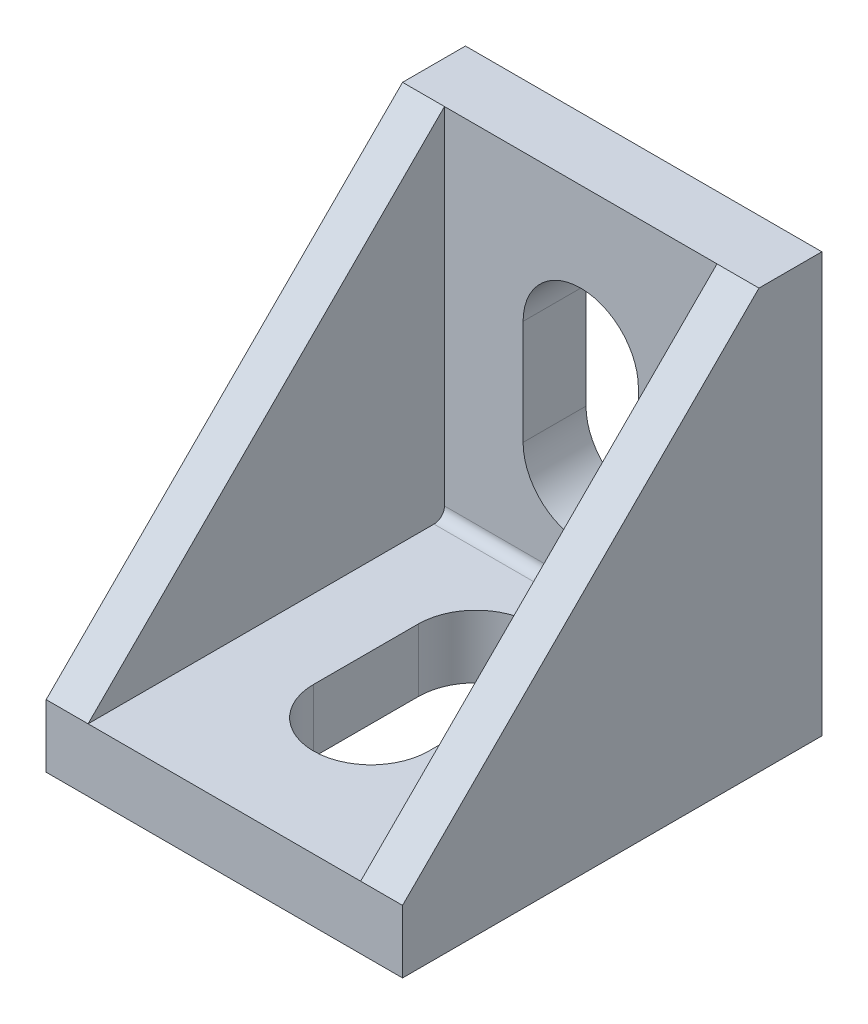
ISO-10303-21;
HEADER;
FILE_DESCRIPTION(('STEP AP214'),'2;1');
FILE_NAME('part.step','',(''),(''),'','','');
FILE_SCHEMA(('AUTOMOTIVE_DESIGN { 1 0 10303 214 1 1 1 1 }'));
ENDSEC;
DATA;
#1=APPLICATION_CONTEXT('core data for automotive mechanical design processes');
#2=APPLICATION_PROTOCOL_DEFINITION('international standard','automotive_design',2000,#1);
#3=PRODUCT_CONTEXT('',#1,'mechanical');
#4=PRODUCT('Part','Part','',(#3));
#5=PRODUCT_RELATED_PRODUCT_CATEGORY('part','',(#4));
#6=PRODUCT_DEFINITION_FORMATION('','',#4);
#7=PRODUCT_DEFINITION_CONTEXT('part definition',#1,'design');
#8=PRODUCT_DEFINITION('design','',#6,#7);
#9=PRODUCT_DEFINITION_SHAPE('','',#8);
#10=(LENGTH_UNIT() NAMED_UNIT(*) SI_UNIT(.MILLI.,.METRE.));
#11=(NAMED_UNIT(*) PLANE_ANGLE_UNIT() SI_UNIT($,.RADIAN.));
#12=(NAMED_UNIT(*) SI_UNIT($,.STERADIAN.) SOLID_ANGLE_UNIT());
#13=UNCERTAINTY_MEASURE_WITH_UNIT(LENGTH_MEASURE(1.E-05),#10,'distance_accuracy_value','');
#14=(GEOMETRIC_REPRESENTATION_CONTEXT(3) GLOBAL_UNCERTAINTY_ASSIGNED_CONTEXT((#13)) GLOBAL_UNIT_ASSIGNED_CONTEXT((#10,
#11,#12)) REPRESENTATION_CONTEXT('',''));
#15=CARTESIAN_POINT('',(0.,0.,0.));
#16=DIRECTION('',(0.,0.,1.));
#17=DIRECTION('',(1.,0.,0.));
#18=AXIS2_PLACEMENT_3D('',#15,#16,#17);
#19=CARTESIAN_POINT('',(0.,0.,1.));
#20=DIRECTION('',(0.,0.,-1.));
#21=DIRECTION('',(0.,1.,0.));
#22=AXIS2_PLACEMENT_3D('',#19,#20,#21);
#23=PLANE('',#22);
#24=DIRECTION('',(0.,-1.,0.));
#25=VECTOR('',#24,1.);
#26=CARTESIAN_POINT('',(6.,19.,1.));
#27=LINE('',#26,#25);
#28=CARTESIAN_POINT('',(6.,19.,1.));
#29=VERTEX_POINT('',#28);
#30=CARTESIAN_POINT('',(6.,16.,1.));
#31=VERTEX_POINT('',#30);
#32=EDGE_CURVE('E357',#29,#31,#27,.T.);
#33=ORIENTED_EDGE('',*,*,#32,.T.);
#34=DIRECTION('',(-1.,0.,0.));
#35=VECTOR('',#34,1.);
#36=CARTESIAN_POINT('',(6.,16.,1.));
#37=LINE('',#36,#35);
#38=CARTESIAN_POINT('',(-6.,16.,1.));
#39=VERTEX_POINT('',#38);
#40=EDGE_CURVE('E360',#31,#39,#37,.T.);
#41=ORIENTED_EDGE('',*,*,#40,.T.);
#42=DIRECTION('',(0.,1.,0.));
#43=VECTOR('',#42,1.);
#44=CARTESIAN_POINT('',(-6.,16.,1.));
#45=LINE('',#44,#43);
#46=CARTESIAN_POINT('',(-6.,19.,1.));
#47=VERTEX_POINT('',#46);
#48=EDGE_CURVE('E364',#39,#47,#45,.T.);
#49=ORIENTED_EDGE('',*,*,#48,.T.);
#50=DIRECTION('',(1.,0.,0.));
#51=VECTOR('',#50,1.);
#52=CARTESIAN_POINT('',(-6.,19.,1.));
#53=LINE('',#52,#51);
#54=EDGE_CURVE('E367',#47,#29,#53,.T.);
#55=ORIENTED_EDGE('',*,*,#54,.T.);
#56=EDGE_LOOP('',(#33,#41,#49,#55));
#57=FACE_BOUND('',#56,.T.);
#58=DIRECTION('',(1.,0.,0.));
#59=VECTOR('',#58,1.);
#60=CARTESIAN_POINT('',(3.,18.,1.));
#61=LINE('',#60,#59);
#62=CARTESIAN_POINT('',(-3.,18.,1.));
#63=VERTEX_POINT('',#62);
#64=CARTESIAN_POINT('',(3.,18.,1.));
#65=VERTEX_POINT('',#64);
#66=EDGE_CURVE('E1317',#63,#65,#61,.T.);
#67=ORIENTED_EDGE('',*,*,#66,.F.);
#68=DIRECTION('',(0.,1.,0.));
#69=VECTOR('',#68,1.);
#70=CARTESIAN_POINT('',(-3.,18.,1.));
#71=LINE('',#70,#69);
#72=CARTESIAN_POINT('',(-3.,17.,1.));
#73=VERTEX_POINT('',#72);
#74=EDGE_CURVE('E347',#73,#63,#71,.T.);
#75=ORIENTED_EDGE('',*,*,#74,.F.);
#76=DIRECTION('',(-1.,0.,0.));
#77=VECTOR('',#76,1.);
#78=CARTESIAN_POINT('',(-3.,17.,1.));
#79=LINE('',#78,#77);
#80=CARTESIAN_POINT('',(3.,17.,1.));
#81=VERTEX_POINT('',#80);
#82=EDGE_CURVE('E343',#81,#73,#79,.T.);
#83=ORIENTED_EDGE('',*,*,#82,.F.);
#84=DIRECTION('',(0.,-1.,0.));
#85=VECTOR('',#84,1.);
#86=CARTESIAN_POINT('',(3.,17.,1.));
#87=LINE('',#86,#85);
#88=EDGE_CURVE('E1314',#65,#81,#87,.T.);
#89=ORIENTED_EDGE('',*,*,#88,.F.);
#90=EDGE_LOOP('',(#67,#75,#83,#89));
#91=FACE_BOUND('',#90,.T.);
#92=ADVANCED_FACE('F32',(#57,#91),#23,.T.);
#93=CARTESIAN_POINT('',(6.,3.,1.));
#94=DIRECTION('',(0.,0.,1.));
#95=DIRECTION('',(1.,0.,0.));
#96=AXIS2_PLACEMENT_3D('',#93,#94,#95);
#97=PLANE('',#96);
#98=DIRECTION('',(1.,0.,0.));
#99=VECTOR('',#98,1.);
#100=CARTESIAN_POINT('',(-3.,2.,0.999999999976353));
#101=LINE('',#100,#99);
#102=CARTESIAN_POINT('',(-3.,2.,0.999999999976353));
#103=VERTEX_POINT('',#102);
#104=CARTESIAN_POINT('',(3.,2.,1.));
#105=VERTEX_POINT('',#104);
#106=EDGE_CURVE('E390',#103,#105,#101,.T.);
#107=ORIENTED_EDGE('',*,*,#106,.F.);
#108=DIRECTION('',(0.,1.,0.));
#109=VECTOR('',#108,1.);
#110=CARTESIAN_POINT('',(-3.,1.,0.999999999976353));
#111=LINE('',#110,#109);
#112=CARTESIAN_POINT('',(-3.,1.,0.999999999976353));
#113=VERTEX_POINT('',#112);
#114=EDGE_CURVE('E388',#113,#103,#111,.T.);
#115=ORIENTED_EDGE('',*,*,#114,.F.);
#116=DIRECTION('',(-1.,0.,0.));
#117=VECTOR('',#116,1.);
#118=CARTESIAN_POINT('',(6.,1.,1.));
#119=LINE('',#118,#117);
#120=CARTESIAN_POINT('',(-6.,1.,1.));
#121=VERTEX_POINT('',#120);
#122=EDGE_CURVE('E587',#113,#121,#119,.T.);
#123=ORIENTED_EDGE('',*,*,#122,.T.);
#124=DIRECTION('',(0.,-1.,0.));
#125=VECTOR('',#124,1.);
#126=CARTESIAN_POINT('',(-6.,3.,1.));
#127=LINE('',#126,#125);
#128=CARTESIAN_POINT('',(-6.,3.,1.));
#129=VERTEX_POINT('',#128);
#130=EDGE_CURVE('E611',#129,#121,#127,.T.);
#131=ORIENTED_EDGE('',*,*,#130,.F.);
#132=DIRECTION('',(-1.,0.,0.));
#133=VECTOR('',#132,1.);
#134=CARTESIAN_POINT('',(6.,3.,1.));
#135=LINE('',#134,#133);
#136=CARTESIAN_POINT('',(6.,3.,1.));
#137=VERTEX_POINT('',#136);
#138=EDGE_CURVE('E598',#137,#129,#135,.T.);
#139=ORIENTED_EDGE('',*,*,#138,.F.);
#140=DIRECTION('',(0.,-1.,0.));
#141=VECTOR('',#140,1.);
#142=CARTESIAN_POINT('',(6.,3.,1.));
#143=LINE('',#142,#141);
#144=CARTESIAN_POINT('',(6.,1.,1.));
#145=VERTEX_POINT('',#144);
#146=EDGE_CURVE('E614',#137,#145,#143,.T.);
#147=ORIENTED_EDGE('',*,*,#146,.T.);
#148=CARTESIAN_POINT('',(3.,1.,0.999999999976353));
#149=VERTEX_POINT('',#148);
#150=EDGE_CURVE('E583',#145,#149,#119,.T.);
#151=ORIENTED_EDGE('',*,*,#150,.T.);
#152=DIRECTION('',(0.,-1.,0.));
#153=VECTOR('',#152,1.);
#154=CARTESIAN_POINT('',(3.,2.,0.999999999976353));
#155=LINE('',#154,#153);
#156=EDGE_CURVE('E393',#105,#149,#155,.T.);
#157=ORIENTED_EDGE('',*,*,#156,.F.);
#158=EDGE_LOOP('',(#107,#115,#123,#131,#139,#147,#151,#157));
#159=FACE_BOUND('',#158,.T.);
#160=ADVANCED_FACE('F756',(#159),#97,.F.);
#161=CARTESIAN_POINT('',(6.,1.,-11.0415945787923));
#162=DIRECTION('',(0.,1.,0.));
#163=DIRECTION('',(0.,0.,1.));
#164=AXIS2_PLACEMENT_3D('',#161,#162,#163);
#165=PLANE('',#164);
#166=DIRECTION('',(0.,0.,1.));
#167=VECTOR('',#166,1.);
#168=CARTESIAN_POINT('',(3.,1.,2.));
#169=LINE('',#168,#167);
#170=CARTESIAN_POINT('',(3.,1.,2.));
#171=VERTEX_POINT('',#170);
#172=EDGE_CURVE('E399',#149,#171,#169,.T.);
#173=ORIENTED_EDGE('',*,*,#172,.F.);
#174=ORIENTED_EDGE('',*,*,#150,.F.);
#175=DIRECTION('',(0.,0.,1.));
#176=VECTOR('',#175,1.);
#177=CARTESIAN_POINT('',(6.,1.,-11.0415945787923));
#178=LINE('',#177,#176);
#179=CARTESIAN_POINT('',(6.,1.,3.));
#180=VERTEX_POINT('',#179);
#181=EDGE_CURVE('E574',#145,#180,#178,.T.);
#182=ORIENTED_EDGE('',*,*,#181,.T.);
#183=DIRECTION('',(-1.,0.,0.));
#184=VECTOR('',#183,1.);
#185=CARTESIAN_POINT('',(6.,1.,3.));
#186=LINE('',#185,#184);
#187=CARTESIAN_POINT('',(-6.,1.,3.));
#188=VERTEX_POINT('',#187);
#189=EDGE_CURVE('E564',#180,#188,#186,.T.);
#190=ORIENTED_EDGE('',*,*,#189,.T.);
#191=DIRECTION('',(0.,0.,1.));
#192=VECTOR('',#191,1.);
#193=CARTESIAN_POINT('',(-6.,1.,-11.0415945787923));
#194=LINE('',#193,#192);
#195=EDGE_CURVE('E586',#121,#188,#194,.T.);
#196=ORIENTED_EDGE('',*,*,#195,.F.);
#197=ORIENTED_EDGE('',*,*,#122,.F.);
#198=DIRECTION('',(0.,0.,-1.));
#199=VECTOR('',#198,1.);
#200=CARTESIAN_POINT('',(-3.,1.,1.));
#201=LINE('',#200,#199);
#202=CARTESIAN_POINT('',(-3.,1.,2.));
#203=VERTEX_POINT('',#202);
#204=EDGE_CURVE('E420',#203,#113,#201,.T.);
#205=ORIENTED_EDGE('',*,*,#204,.F.);
#206=DIRECTION('',(-1.,0.,0.));
#207=VECTOR('',#206,1.);
#208=CARTESIAN_POINT('',(-3.,1.,2.));
#209=LINE('',#208,#207);
#210=EDGE_CURVE('E429',#171,#203,#209,.T.);
#211=ORIENTED_EDGE('',*,*,#210,.F.);
#212=EDGE_LOOP('',(#173,#174,#182,#190,#196,#197,#205,#211));
#213=FACE_BOUND('',#212,.T.);
#214=ADVANCED_FACE('F762',(#213),#165,.F.);
#215=CARTESIAN_POINT('',(0.,1.,0.));
#216=DIRECTION('',(0.,-1.,0.));
#217=DIRECTION('',(0.,0.,-1.));
#218=AXIS2_PLACEMENT_3D('',#215,#216,#217);
#219=PLANE('',#218);
#220=DIRECTION('',(0.,0.,1.));
#221=VECTOR('',#220,1.);
#222=CARTESIAN_POINT('',(6.,1.,16.));
#223=LINE('',#222,#221);
#224=CARTESIAN_POINT('',(6.,1.,16.));
#225=VERTEX_POINT('',#224);
#226=CARTESIAN_POINT('',(6.,1.,19.));
#227=VERTEX_POINT('',#226);
#228=EDGE_CURVE('E475',#225,#227,#223,.T.);
#229=ORIENTED_EDGE('',*,*,#228,.T.);
#230=DIRECTION('',(-1.,0.,0.));
#231=VECTOR('',#230,1.);
#232=CARTESIAN_POINT('',(6.,1.,19.));
#233=LINE('',#232,#231);
#234=CARTESIAN_POINT('',(-6.,1.,19.));
#235=VERTEX_POINT('',#234);
#236=EDGE_CURVE('E478',#227,#235,#233,.T.);
#237=ORIENTED_EDGE('',*,*,#236,.T.);
#238=DIRECTION('',(0.,0.,-1.));
#239=VECTOR('',#238,1.);
#240=CARTESIAN_POINT('',(-6.,1.,19.));
#241=LINE('',#240,#239);
#242=CARTESIAN_POINT('',(-6.,1.,16.));
#243=VERTEX_POINT('',#242);
#244=EDGE_CURVE('E482',#235,#243,#241,.T.);
#245=ORIENTED_EDGE('',*,*,#244,.T.);
#246=DIRECTION('',(1.,0.,0.));
#247=VECTOR('',#246,1.);
#248=CARTESIAN_POINT('',(-6.,1.,16.));
#249=LINE('',#248,#247);
#250=EDGE_CURVE('E485',#243,#225,#249,.T.);
#251=ORIENTED_EDGE('',*,*,#250,.T.);
#252=EDGE_LOOP('',(#229,#237,#245,#251));
#253=FACE_BOUND('',#252,.T.);
#254=DIRECTION('',(1.,0.,0.));
#255=VECTOR('',#254,1.);
#256=CARTESIAN_POINT('',(3.,1.,17.));
#257=LINE('',#256,#255);
#258=CARTESIAN_POINT('',(-3.,1.,17.));
#259=VERTEX_POINT('',#258);
#260=CARTESIAN_POINT('',(3.,1.,17.));
#261=VERTEX_POINT('',#260);
#262=EDGE_CURVE('E459',#259,#261,#257,.T.);
#263=ORIENTED_EDGE('',*,*,#262,.F.);
#264=DIRECTION('',(0.,0.,-1.));
#265=VECTOR('',#264,1.);
#266=CARTESIAN_POINT('',(-3.,1.,17.));
#267=LINE('',#266,#265);
#268=CARTESIAN_POINT('',(-3.,1.,18.));
#269=VERTEX_POINT('',#268);
#270=EDGE_CURVE('E445',#269,#259,#267,.T.);
#271=ORIENTED_EDGE('',*,*,#270,.F.);
#272=DIRECTION('',(-1.,0.,0.));
#273=VECTOR('',#272,1.);
#274=CARTESIAN_POINT('',(-3.,1.,18.));
#275=LINE('',#274,#273);
#276=CARTESIAN_POINT('',(3.,1.,18.));
#277=VERTEX_POINT('',#276);
#278=EDGE_CURVE('E450',#277,#269,#275,.T.);
#279=ORIENTED_EDGE('',*,*,#278,.F.);
#280=DIRECTION('',(0.,0.,1.));
#281=VECTOR('',#280,1.);
#282=CARTESIAN_POINT('',(3.,1.,18.));
#283=LINE('',#282,#281);
#284=EDGE_CURVE('E461',#261,#277,#283,.T.);
#285=ORIENTED_EDGE('',*,*,#284,.F.);
#286=EDGE_LOOP('',(#263,#271,#279,#285));
#287=FACE_BOUND('',#286,.T.);
#288=ADVANCED_FACE('F843',(#253,#287),#219,.T.);
#289=CARTESIAN_POINT('',(-8.5,20.,3.));
#290=DIRECTION('',(0.,0.707106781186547,0.707106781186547));
#291=DIRECTION('',(0.,-0.707106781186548,0.707106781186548));
#292=AXIS2_PLACEMENT_3D('',#289,#290,#291);
#293=PLANE('',#292);
#294=DIRECTION('',(1.,0.,0.));
#295=VECTOR('',#294,1.);
#296=CARTESIAN_POINT('',(-8.5,20.,3.));
#297=LINE('',#296,#295);
#298=CARTESIAN_POINT('',(6.5,20.,3.));
#299=VERTEX_POINT('',#298);
#300=CARTESIAN_POINT('',(8.5,20.,3.));
#301=VERTEX_POINT('',#300);
#302=EDGE_CURVE('E682',#299,#301,#297,.T.);
#303=ORIENTED_EDGE('',*,*,#302,.F.);
#304=DIRECTION('',(0.,-0.707106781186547,0.707106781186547));
#305=VECTOR('',#304,1.);
#306=CARTESIAN_POINT('',(6.5,20.,3.));
#307=LINE('',#306,#305);
#308=CARTESIAN_POINT('',(6.5,3.,20.));
#309=VERTEX_POINT('',#308);
#310=EDGE_CURVE('E643',#299,#309,#307,.T.);
#311=ORIENTED_EDGE('',*,*,#310,.T.);
#312=DIRECTION('',(1.,0.,0.));
#313=VECTOR('',#312,1.);
#314=CARTESIAN_POINT('',(-8.5,3.,20.));
#315=LINE('',#314,#313);
#316=CARTESIAN_POINT('',(8.5,3.,20.));
#317=VERTEX_POINT('',#316);
#318=EDGE_CURVE('E651',#309,#317,#315,.T.);
#319=ORIENTED_EDGE('',*,*,#318,.T.);
#320=DIRECTION('',(0.,-0.707106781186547,0.707106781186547));
#321=VECTOR('',#320,1.);
#322=CARTESIAN_POINT('',(8.5,20.,3.));
#323=LINE('',#322,#321);
#324=EDGE_CURVE('E677',#301,#317,#323,.T.);
#325=ORIENTED_EDGE('',*,*,#324,.F.);
#326=EDGE_LOOP('',(#303,#311,#319,#325));
#327=FACE_BOUND('',#326,.T.);
#328=ADVANCED_FACE('F715',(#327),#293,.T.);
#329=DIRECTION('',(0.,-0.707106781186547,0.707106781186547));
#330=VECTOR('',#329,1.);
#331=CARTESIAN_POINT('',(-6.5,20.,3.));
#332=LINE('',#331,#330);
#333=CARTESIAN_POINT('',(-6.5,20.,3.));
#334=VERTEX_POINT('',#333);
#335=CARTESIAN_POINT('',(-6.5,3.,20.));
#336=VERTEX_POINT('',#335);
#337=EDGE_CURVE('E639',#334,#336,#332,.T.);
#338=ORIENTED_EDGE('',*,*,#337,.F.);
#339=CARTESIAN_POINT('',(-8.5,20.,3.));
#340=VERTEX_POINT('',#339);
#341=EDGE_CURVE('E670',#340,#334,#297,.T.);
#342=ORIENTED_EDGE('',*,*,#341,.F.);
#343=DIRECTION('',(0.,-0.707106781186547,0.707106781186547));
#344=VECTOR('',#343,1.);
#345=CARTESIAN_POINT('',(-8.5,20.,3.));
#346=LINE('',#345,#344);
#347=CARTESIAN_POINT('',(-8.5,3.,20.));
#348=VERTEX_POINT('',#347);
#349=EDGE_CURVE('E706',#340,#348,#346,.T.);
#350=ORIENTED_EDGE('',*,*,#349,.T.);
#351=EDGE_CURVE('E661',#348,#336,#315,.T.);
#352=ORIENTED_EDGE('',*,*,#351,.T.);
#353=EDGE_LOOP('',(#338,#342,#350,#352));
#354=FACE_BOUND('',#353,.T.);
#355=ADVANCED_FACE('F691',(#354),#293,.T.);
#356=CARTESIAN_POINT('',(-8.5,0.,0.));
#357=DIRECTION('',(1.,0.,0.));
#358=DIRECTION('',(0.,0.,-1.));
#359=AXIS2_PLACEMENT_3D('',#356,#357,#358);
#360=PLANE('',#359);
#361=DIRECTION('',(0.,1.,0.));
#362=VECTOR('',#361,1.);
#363=CARTESIAN_POINT('',(-8.5,20.,0.));
#364=LINE('',#363,#362);
#365=CARTESIAN_POINT('',(-8.5,0.,0.));
#366=VERTEX_POINT('',#365);
#367=CARTESIAN_POINT('',(-8.5,20.,0.));
#368=VERTEX_POINT('',#367);
#369=EDGE_CURVE('E724',#366,#368,#364,.T.);
#370=ORIENTED_EDGE('',*,*,#369,.F.);
#371=DIRECTION('',(0.,0.,-1.));
#372=VECTOR('',#371,1.);
#373=CARTESIAN_POINT('',(-8.5,0.,0.));
#374=LINE('',#373,#372);
#375=CARTESIAN_POINT('',(-8.5,0.,20.));
#376=VERTEX_POINT('',#375);
#377=EDGE_CURVE('E626',#376,#366,#374,.T.);
#378=ORIENTED_EDGE('',*,*,#377,.F.);
#379=DIRECTION('',(0.,1.,0.));
#380=VECTOR('',#379,1.);
#381=CARTESIAN_POINT('',(-8.5,0.,20.));
#382=LINE('',#381,#380);
#383=EDGE_CURVE('E629',#376,#348,#382,.T.);
#384=ORIENTED_EDGE('',*,*,#383,.T.);
#385=ORIENTED_EDGE('',*,*,#349,.F.);
#386=DIRECTION('',(0.,0.,1.));
#387=VECTOR('',#386,1.);
#388=CARTESIAN_POINT('',(-8.5,20.,0.));
#389=LINE('',#388,#387);
#390=EDGE_CURVE('E699',#368,#340,#389,.T.);
#391=ORIENTED_EDGE('',*,*,#390,.F.);
#392=EDGE_LOOP('',(#370,#378,#384,#385,#391));
#393=FACE_BOUND('',#392,.T.);
#394=ADVANCED_FACE('F730',(#393),#360,.F.);
#395=CARTESIAN_POINT('',(8.5,0.,0.));
#396=DIRECTION('',(1.,0.,0.));
#397=DIRECTION('',(0.,0.,-1.));
#398=AXIS2_PLACEMENT_3D('',#395,#396,#397);
#399=PLANE('',#398);
#400=ORIENTED_EDGE('',*,*,#324,.T.);
#401=DIRECTION('',(0.,1.,0.));
#402=VECTOR('',#401,1.);
#403=CARTESIAN_POINT('',(8.5,0.,20.));
#404=LINE('',#403,#402);
#405=CARTESIAN_POINT('',(8.5,0.,20.));
#406=VERTEX_POINT('',#405);
#407=EDGE_CURVE('E636',#406,#317,#404,.T.);
#408=ORIENTED_EDGE('',*,*,#407,.F.);
#409=DIRECTION('',(0.,0.,1.));
#410=VECTOR('',#409,1.);
#411=CARTESIAN_POINT('',(8.5,0.,20.));
#412=LINE('',#411,#410);
#413=CARTESIAN_POINT('',(8.5,0.,0.));
#414=VERTEX_POINT('',#413);
#415=EDGE_CURVE('E621',#414,#406,#412,.T.);
#416=ORIENTED_EDGE('',*,*,#415,.F.);
#417=DIRECTION('',(0.,-1.,0.));
#418=VECTOR('',#417,1.);
#419=CARTESIAN_POINT('',(8.5,3.,0.));
#420=LINE('',#419,#418);
#421=CARTESIAN_POINT('',(8.5,20.,0.));
#422=VERTEX_POINT('',#421);
#423=EDGE_CURVE('E708',#422,#414,#420,.T.);
#424=ORIENTED_EDGE('',*,*,#423,.F.);
#425=DIRECTION('',(0.,0.,1.));
#426=VECTOR('',#425,1.);
#427=CARTESIAN_POINT('',(8.5,20.,0.));
#428=LINE('',#427,#426);
#429=EDGE_CURVE('E703',#422,#301,#428,.T.);
#430=ORIENTED_EDGE('',*,*,#429,.T.);
#431=EDGE_LOOP('',(#400,#408,#416,#424,#430));
#432=FACE_BOUND('',#431,.T.);
#433=ADVANCED_FACE('F719',(#432),#399,.T.);
#434=CARTESIAN_POINT('',(8.5,20.,0.));
#435=DIRECTION('',(0.,-1.,0.));
#436=DIRECTION('',(0.,0.,-1.));
#437=AXIS2_PLACEMENT_3D('',#434,#435,#436);
#438=PLANE('',#437);
#439=ORIENTED_EDGE('',*,*,#341,.T.);
#440=DIRECTION('',(1.,0.,0.));
#441=VECTOR('',#440,1.);
#442=CARTESIAN_POINT('',(-6.5,20.,3.));
#443=LINE('',#442,#441);
#444=EDGE_CURVE('E646',#334,#299,#443,.T.);
#445=ORIENTED_EDGE('',*,*,#444,.T.);
#446=ORIENTED_EDGE('',*,*,#302,.T.);
#447=ORIENTED_EDGE('',*,*,#429,.F.);
#448=DIRECTION('',(1.,0.,0.));
#449=VECTOR('',#448,1.);
#450=CARTESIAN_POINT('',(8.5,20.,0.));
#451=LINE('',#450,#449);
#452=EDGE_CURVE('E701',#368,#422,#451,.T.);
#453=ORIENTED_EDGE('',*,*,#452,.F.);
#454=ORIENTED_EDGE('',*,*,#390,.T.);
#455=EDGE_LOOP('',(#439,#445,#446,#447,#453,#454));
#456=FACE_BOUND('',#455,.T.);
#457=ADVANCED_FACE('F696',(#456),#438,.F.);
#458=CARTESIAN_POINT('',(0.,0.,0.));
#459=DIRECTION('',(0.,0.,1.));
#460=DIRECTION('',(0.,-1.,0.));
#461=AXIS2_PLACEMENT_3D('',#458,#459,#460);
#462=PLANE('',#461);
#463=DIRECTION('',(-1.,0.,0.));
#464=VECTOR('',#463,1.);
#465=CARTESIAN_POINT('',(6.,16.,0.));
#466=LINE('',#465,#464);
#467=CARTESIAN_POINT('',(6.,16.,0.));
#468=VERTEX_POINT('',#467);
#469=CARTESIAN_POINT('',(-6.,16.,0.));
#470=VERTEX_POINT('',#469);
#471=EDGE_CURVE('E351',#468,#470,#466,.T.);
#472=ORIENTED_EDGE('',*,*,#471,.F.);
#473=DIRECTION('',(0.,-1.,0.));
#474=VECTOR('',#473,1.);
#475=CARTESIAN_POINT('',(6.,19.,0.));
#476=LINE('',#475,#474);
#477=CARTESIAN_POINT('',(6.,19.,0.));
#478=VERTEX_POINT('',#477);
#479=EDGE_CURVE('E349',#478,#468,#476,.T.);
#480=ORIENTED_EDGE('',*,*,#479,.F.);
#481=DIRECTION('',(1.,0.,0.));
#482=VECTOR('',#481,1.);
#483=CARTESIAN_POINT('',(-6.,19.,0.));
#484=LINE('',#483,#482);
#485=CARTESIAN_POINT('',(-6.,19.,0.));
#486=VERTEX_POINT('',#485);
#487=EDGE_CURVE('E361',#486,#478,#484,.T.);
#488=ORIENTED_EDGE('',*,*,#487,.F.);
#489=DIRECTION('',(0.,1.,0.));
#490=VECTOR('',#489,1.);
#491=CARTESIAN_POINT('',(-6.,16.,0.));
#492=LINE('',#491,#490);
#493=EDGE_CURVE('E373',#470,#486,#492,.T.);
#494=ORIENTED_EDGE('',*,*,#493,.F.);
#495=EDGE_LOOP('',(#472,#480,#488,#494));
#496=FACE_BOUND('',#495,.T.);
#497=DIRECTION('',(0.,1.,0.));
#498=VECTOR('',#497,1.);
#499=CARTESIAN_POINT('',(2.75,8.,0.));
#500=LINE('',#499,#498);
#501=CARTESIAN_POINT('',(2.75,8.,0.));
#502=VERTEX_POINT('',#501);
#503=CARTESIAN_POINT('',(2.75,13.,0.));
#504=VERTEX_POINT('',#503);
#505=EDGE_CURVE('E549',#502,#504,#500,.T.);
#506=ORIENTED_EDGE('',*,*,#505,.T.);
#507=CARTESIAN_POINT('',(0.,13.,0.));
#508=DIRECTION('',(0.,0.,1.));
#509=DIRECTION('',(1.,0.,0.));
#510=AXIS2_PLACEMENT_3D('',#507,#508,#509);
#511=CIRCLE('',#510,2.75);
#512=CARTESIAN_POINT('',(-2.75,13.,0.));
#513=VERTEX_POINT('',#512);
#514=EDGE_CURVE('E539',#504,#513,#511,.T.);
#515=ORIENTED_EDGE('',*,*,#514,.T.);
#516=DIRECTION('',(0.,-1.,0.));
#517=VECTOR('',#516,1.);
#518=CARTESIAN_POINT('',(-2.75,13.,0.));
#519=LINE('',#518,#517);
#520=CARTESIAN_POINT('',(-2.75,8.,0.));
#521=VERTEX_POINT('',#520);
#522=EDGE_CURVE('E542',#513,#521,#519,.T.);
#523=ORIENTED_EDGE('',*,*,#522,.T.);
#524=CARTESIAN_POINT('',(0.,8.,0.));
#525=DIRECTION('',(0.,0.,1.));
#526=DIRECTION('',(1.,0.,0.));
#527=AXIS2_PLACEMENT_3D('',#524,#525,#526);
#528=CIRCLE('',#527,2.75);
#529=EDGE_CURVE('E546',#521,#502,#528,.T.);
#530=ORIENTED_EDGE('',*,*,#529,.T.);
#531=EDGE_LOOP('',(#506,#515,#523,#530));
#532=FACE_BOUND('',#531,.T.);
#533=DIRECTION('',(1.,0.,0.));
#534=VECTOR('',#533,1.);
#535=CARTESIAN_POINT('',(-6.,3.,0.));
#536=LINE('',#535,#534);
#537=CARTESIAN_POINT('',(-6.,3.,0.));
#538=VERTEX_POINT('',#537);
#539=CARTESIAN_POINT('',(6.,3.,0.));
#540=VERTEX_POINT('',#539);
#541=EDGE_CURVE('E591',#538,#540,#536,.T.);
#542=ORIENTED_EDGE('',*,*,#541,.F.);
#543=DIRECTION('',(0.,-1.,0.));
#544=VECTOR('',#543,1.);
#545=CARTESIAN_POINT('',(-6.,3.,0.));
#546=LINE('',#545,#544);
#547=CARTESIAN_POINT('',(-6.,0.,0.));
#548=VERTEX_POINT('',#547);
#549=EDGE_CURVE('E607',#538,#548,#546,.T.);
#550=ORIENTED_EDGE('',*,*,#549,.T.);
#551=DIRECTION('',(1.,0.,0.));
#552=VECTOR('',#551,1.);
#553=CARTESIAN_POINT('',(8.5,0.,0.));
#554=LINE('',#553,#552);
#555=EDGE_CURVE('E618',#366,#548,#554,.T.);
#556=ORIENTED_EDGE('',*,*,#555,.F.);
#557=ORIENTED_EDGE('',*,*,#369,.T.);
#558=ORIENTED_EDGE('',*,*,#452,.T.);
#559=ORIENTED_EDGE('',*,*,#423,.T.);
#560=CARTESIAN_POINT('',(6.,0.,0.));
#561=VERTEX_POINT('',#560);
#562=EDGE_CURVE('E622',#561,#414,#554,.T.);
#563=ORIENTED_EDGE('',*,*,#562,.F.);
#564=DIRECTION('',(0.,-1.,0.));
#565=VECTOR('',#564,1.);
#566=CARTESIAN_POINT('',(6.,3.,0.));
#567=LINE('',#566,#565);
#568=EDGE_CURVE('E604',#540,#561,#567,.T.);
#569=ORIENTED_EDGE('',*,*,#568,.F.);
#570=EDGE_LOOP('',(#542,#550,#556,#557,#558,#559,#563,#569));
#571=FACE_BOUND('',#570,.T.);
#572=ADVANCED_FACE('F728',(#496,#532,#571),#462,.F.);
#573=CARTESIAN_POINT('',(-6.5,3.,3.));
#574=DIRECTION('',(0.,0.,-1.));
#575=DIRECTION('',(0.,1.,0.));
#576=AXIS2_PLACEMENT_3D('',#573,#574,#575);
#577=PLANE('',#576);
#578=DIRECTION('',(0.,-1.,0.));
#579=VECTOR('',#578,1.);
#580=CARTESIAN_POINT('',(-2.75,13.,3.));
#581=LINE('',#580,#579);
#582=CARTESIAN_POINT('',(-2.75,13.,3.));
#583=VERTEX_POINT('',#582);
#584=CARTESIAN_POINT('',(-2.75,8.,3.));
#585=VERTEX_POINT('',#584);
#586=EDGE_CURVE('E554',#583,#585,#581,.T.);
#587=ORIENTED_EDGE('',*,*,#586,.F.);
#588=CARTESIAN_POINT('',(0.,13.,3.));
#589=DIRECTION('',(0.,0.,1.));
#590=DIRECTION('',(1.,0.,0.));
#591=AXIS2_PLACEMENT_3D('',#588,#589,#590);
#592=CIRCLE('',#591,2.75);
#593=CARTESIAN_POINT('',(2.75,13.,3.));
#594=VERTEX_POINT('',#593);
#595=EDGE_CURVE('E532',#594,#583,#592,.T.);
#596=ORIENTED_EDGE('',*,*,#595,.F.);
#597=DIRECTION('',(0.,1.,0.));
#598=VECTOR('',#597,1.);
#599=CARTESIAN_POINT('',(2.75,8.,3.));
#600=LINE('',#599,#598);
#601=CARTESIAN_POINT('',(2.75,8.,3.));
#602=VERTEX_POINT('',#601);
#603=EDGE_CURVE('E543',#602,#594,#600,.T.);
#604=ORIENTED_EDGE('',*,*,#603,.F.);
#605=CARTESIAN_POINT('',(0.,8.,3.));
#606=DIRECTION('',(0.,0.,1.));
#607=DIRECTION('',(1.,0.,0.));
#608=AXIS2_PLACEMENT_3D('',#605,#606,#607);
#609=CIRCLE('',#608,2.75);
#610=EDGE_CURVE('E557',#585,#602,#609,.T.);
#611=ORIENTED_EDGE('',*,*,#610,.F.);
#612=EDGE_LOOP('',(#587,#596,#604,#611));
#613=FACE_BOUND('',#612,.T.);
#614=DIRECTION('',(0.,1.,0.));
#615=VECTOR('',#614,1.);
#616=CARTESIAN_POINT('',(-6.5,3.,3.));
#617=LINE('',#616,#615);
#618=CARTESIAN_POINT('',(-6.5,3.5,3.));
#619=VERTEX_POINT('',#618);
#620=EDGE_CURVE('E637',#619,#334,#617,.T.);
#621=ORIENTED_EDGE('',*,*,#620,.F.);
#622=DIRECTION('',(1.,0.,0.));
#623=VECTOR('',#622,1.);
#624=CARTESIAN_POINT('',(-6.5,3.5,3.));
#625=LINE('',#624,#623);
#626=CARTESIAN_POINT('',(6.5,3.5,3.));
#627=VERTEX_POINT('',#626);
#628=EDGE_CURVE('E658',#619,#627,#625,.T.);
#629=ORIENTED_EDGE('',*,*,#628,.T.);
#630=DIRECTION('',(0.,1.,0.));
#631=VECTOR('',#630,1.);
#632=CARTESIAN_POINT('',(6.5,3.,3.));
#633=LINE('',#632,#631);
#634=EDGE_CURVE('E641',#627,#299,#633,.T.);
#635=ORIENTED_EDGE('',*,*,#634,.T.);
#636=ORIENTED_EDGE('',*,*,#444,.F.);
#637=EDGE_LOOP('',(#621,#629,#635,#636));
#638=FACE_BOUND('',#637,.T.);
#639=ADVANCED_FACE('F742',(#613,#638),#577,.F.);
#640=CARTESIAN_POINT('',(-6.5,0.,0.));
#641=DIRECTION('',(-1.,0.,0.));
#642=DIRECTION('',(0.,0.,1.));
#643=AXIS2_PLACEMENT_3D('',#640,#641,#642);
#644=PLANE('',#643);
#645=DIRECTION('',(0.,0.,-1.));
#646=VECTOR('',#645,1.);
#647=CARTESIAN_POINT('',(-6.5,3.,20.));
#648=LINE('',#647,#646);
#649=CARTESIAN_POINT('',(-6.5,3.,3.5));
#650=VERTEX_POINT('',#649);
#651=EDGE_CURVE('E683',#336,#650,#648,.T.);
#652=ORIENTED_EDGE('',*,*,#651,.T.);
#653=CARTESIAN_POINT('',(-6.5,3.5,3.5));
#654=DIRECTION('',(-1.,0.,0.));
#655=DIRECTION('',(0.,0.,1.));
#656=AXIS2_PLACEMENT_3D('',#653,#654,#655);
#657=CIRCLE('',#656,0.5);
#658=EDGE_CURVE('E11',#650,#619,#657,.F.);
#659=ORIENTED_EDGE('',*,*,#658,.T.);
#660=ORIENTED_EDGE('',*,*,#620,.T.);
#661=ORIENTED_EDGE('',*,*,#337,.T.);
#662=EDGE_LOOP('',(#652,#659,#660,#661));
#663=FACE_BOUND('',#662,.T.);
#664=ADVANCED_FACE('F688',(#663),#644,.F.);
#665=CARTESIAN_POINT('',(6.5,0.,0.));
#666=DIRECTION('',(-1.,0.,0.));
#667=DIRECTION('',(0.,0.,1.));
#668=AXIS2_PLACEMENT_3D('',#665,#666,#667);
#669=PLANE('',#668);
#670=ORIENTED_EDGE('',*,*,#634,.F.);
#671=CARTESIAN_POINT('',(6.5,3.5,3.5));
#672=DIRECTION('',(-1.,0.,0.));
#673=DIRECTION('',(0.,0.,1.));
#674=AXIS2_PLACEMENT_3D('',#671,#672,#673);
#675=CIRCLE('',#674,0.5);
#676=CARTESIAN_POINT('',(6.5,3.,3.5));
#677=VERTEX_POINT('',#676);
#678=EDGE_CURVE('E54',#627,#677,#675,.T.);
#679=ORIENTED_EDGE('',*,*,#678,.T.);
#680=DIRECTION('',(0.,0.,-1.));
#681=VECTOR('',#680,1.);
#682=CARTESIAN_POINT('',(6.5,3.,20.));
#683=LINE('',#682,#681);
#684=EDGE_CURVE('E640',#309,#677,#683,.T.);
#685=ORIENTED_EDGE('',*,*,#684,.F.);
#686=ORIENTED_EDGE('',*,*,#310,.F.);
#687=EDGE_LOOP('',(#670,#679,#685,#686));
#688=FACE_BOUND('',#687,.T.);
#689=ADVANCED_FACE('F739',(#688),#669,.T.);
#690=CARTESIAN_POINT('',(0.,3.,0.));
#691=DIRECTION('',(0.,1.,0.));
#692=DIRECTION('',(0.,0.,1.));
#693=AXIS2_PLACEMENT_3D('',#690,#691,#692);
#694=PLANE('',#693);
#695=CARTESIAN_POINT('',(0.,3.,13.));
#696=DIRECTION('',(0.,1.,0.));
#697=DIRECTION('',(0.,0.,1.));
#698=AXIS2_PLACEMENT_3D('',#695,#696,#697);
#699=CIRCLE('',#698,2.75);
#700=CARTESIAN_POINT('',(-2.75,3.,13.));
#701=VERTEX_POINT('',#700);
#702=CARTESIAN_POINT('',(2.75,3.,13.));
#703=VERTEX_POINT('',#702);
#704=EDGE_CURVE('E500',#701,#703,#699,.T.);
#705=ORIENTED_EDGE('',*,*,#704,.F.);
#706=DIRECTION('',(0.,0.,1.));
#707=VECTOR('',#706,1.);
#708=CARTESIAN_POINT('',(-2.75,3.,8.));
#709=LINE('',#708,#707);
#710=CARTESIAN_POINT('',(-2.75,3.,8.));
#711=VERTEX_POINT('',#710);
#712=EDGE_CURVE('E511',#711,#701,#709,.T.);
#713=ORIENTED_EDGE('',*,*,#712,.F.);
#714=CARTESIAN_POINT('',(0.,3.,8.));
#715=DIRECTION('',(0.,1.,0.));
#716=DIRECTION('',(0.,0.,1.));
#717=AXIS2_PLACEMENT_3D('',#714,#715,#716);
#718=CIRCLE('',#717,2.75);
#719=CARTESIAN_POINT('',(2.75,3.,8.));
#720=VERTEX_POINT('',#719);
#721=EDGE_CURVE('E525',#720,#711,#718,.T.);
#722=ORIENTED_EDGE('',*,*,#721,.F.);
#723=DIRECTION('',(0.,0.,-1.));
#724=VECTOR('',#723,1.);
#725=CARTESIAN_POINT('',(2.75,3.,13.));
#726=LINE('',#725,#724);
#727=EDGE_CURVE('E522',#703,#720,#726,.T.);
#728=ORIENTED_EDGE('',*,*,#727,.F.);
#729=EDGE_LOOP('',(#705,#713,#722,#728));
#730=FACE_BOUND('',#729,.T.);
#731=ORIENTED_EDGE('',*,*,#684,.T.);
#732=DIRECTION('',(1.,0.,0.));
#733=VECTOR('',#732,1.);
#734=CARTESIAN_POINT('',(0.,3.,3.5));
#735=LINE('',#734,#733);
#736=EDGE_CURVE('E40',#677,#650,#735,.F.);
#737=ORIENTED_EDGE('',*,*,#736,.T.);
#738=ORIENTED_EDGE('',*,*,#651,.F.);
#739=DIRECTION('',(-1.,0.,0.));
#740=VECTOR('',#739,1.);
#741=CARTESIAN_POINT('',(-8.5,3.,20.));
#742=LINE('',#741,#740);
#743=EDGE_CURVE('E610',#309,#336,#742,.T.);
#744=ORIENTED_EDGE('',*,*,#743,.F.);
#745=EDGE_LOOP('',(#731,#737,#738,#744));
#746=FACE_BOUND('',#745,.T.);
#747=ADVANCED_FACE('F740',(#730,#746),#694,.T.);
#748=CARTESIAN_POINT('',(-8.5,0.,20.));
#749=DIRECTION('',(0.,0.,-1.));
#750=DIRECTION('',(-1.,0.,0.));
#751=AXIS2_PLACEMENT_3D('',#748,#749,#750);
#752=PLANE('',#751);
#753=ORIENTED_EDGE('',*,*,#318,.F.);
#754=ORIENTED_EDGE('',*,*,#743,.T.);
#755=ORIENTED_EDGE('',*,*,#351,.F.);
#756=ORIENTED_EDGE('',*,*,#383,.F.);
#757=DIRECTION('',(-1.,0.,0.));
#758=VECTOR('',#757,1.);
#759=CARTESIAN_POINT('',(-8.5,0.,20.));
#760=LINE('',#759,#758);
#761=EDGE_CURVE('E624',#406,#376,#760,.T.);
#762=ORIENTED_EDGE('',*,*,#761,.F.);
#763=ORIENTED_EDGE('',*,*,#407,.T.);
#764=EDGE_LOOP('',(#753,#754,#755,#756,#762,#763));
#765=FACE_BOUND('',#764,.T.);
#766=ADVANCED_FACE('F737',(#765),#752,.F.);
#767=CARTESIAN_POINT('',(0.,0.,0.));
#768=DIRECTION('',(0.,1.,0.));
#769=DIRECTION('',(0.,0.,1.));
#770=AXIS2_PLACEMENT_3D('',#767,#768,#769);
#771=PLANE('',#770);
#772=DIRECTION('',(-1.,0.,0.));
#773=VECTOR('',#772,1.);
#774=CARTESIAN_POINT('',(6.,0.,19.));
#775=LINE('',#774,#773);
#776=CARTESIAN_POINT('',(6.,0.,19.));
#777=VERTEX_POINT('',#776);
#778=CARTESIAN_POINT('',(-6.,0.,19.));
#779=VERTEX_POINT('',#778);
#780=EDGE_CURVE('E490',#777,#779,#775,.T.);
#781=ORIENTED_EDGE('',*,*,#780,.F.);
#782=DIRECTION('',(0.,0.,1.));
#783=VECTOR('',#782,1.);
#784=CARTESIAN_POINT('',(6.,0.,16.));
#785=LINE('',#784,#783);
#786=CARTESIAN_POINT('',(6.,0.,16.));
#787=VERTEX_POINT('',#786);
#788=EDGE_CURVE('E474',#787,#777,#785,.T.);
#789=ORIENTED_EDGE('',*,*,#788,.F.);
#790=DIRECTION('',(1.,0.,0.));
#791=VECTOR('',#790,1.);
#792=CARTESIAN_POINT('',(-6.,0.,16.));
#793=LINE('',#792,#791);
#794=CARTESIAN_POINT('',(-6.,0.,16.));
#795=VERTEX_POINT('',#794);
#796=EDGE_CURVE('E479',#795,#787,#793,.T.);
#797=ORIENTED_EDGE('',*,*,#796,.F.);
#798=DIRECTION('',(0.,0.,-1.));
#799=VECTOR('',#798,1.);
#800=CARTESIAN_POINT('',(-6.,0.,19.));
#801=LINE('',#800,#799);
#802=EDGE_CURVE('E493',#779,#795,#801,.T.);
#803=ORIENTED_EDGE('',*,*,#802,.F.);
#804=EDGE_LOOP('',(#781,#789,#797,#803));
#805=FACE_BOUND('',#804,.T.);
#806=DIRECTION('',(0.,0.,1.));
#807=VECTOR('',#806,1.);
#808=CARTESIAN_POINT('',(-2.75,0.,8.));
#809=LINE('',#808,#807);
#810=CARTESIAN_POINT('',(-2.75,0.,8.));
#811=VERTEX_POINT('',#810);
#812=CARTESIAN_POINT('',(-2.75,0.,13.));
#813=VERTEX_POINT('',#812);
#814=EDGE_CURVE('E517',#811,#813,#809,.T.);
#815=ORIENTED_EDGE('',*,*,#814,.T.);
#816=CARTESIAN_POINT('',(0.,0.,13.));
#817=DIRECTION('',(0.,1.,0.));
#818=DIRECTION('',(0.,0.,1.));
#819=AXIS2_PLACEMENT_3D('',#816,#817,#818);
#820=CIRCLE('',#819,2.75);
#821=CARTESIAN_POINT('',(2.75,0.,13.));
#822=VERTEX_POINT('',#821);
#823=EDGE_CURVE('E507',#813,#822,#820,.T.);
#824=ORIENTED_EDGE('',*,*,#823,.T.);
#825=DIRECTION('',(0.,0.,-1.));
#826=VECTOR('',#825,1.);
#827=CARTESIAN_POINT('',(2.75,0.,13.));
#828=LINE('',#827,#826);
#829=CARTESIAN_POINT('',(2.75,0.,8.));
#830=VERTEX_POINT('',#829);
#831=EDGE_CURVE('E510',#822,#830,#828,.T.);
#832=ORIENTED_EDGE('',*,*,#831,.T.);
#833=CARTESIAN_POINT('',(0.,0.,8.));
#834=DIRECTION('',(0.,1.,0.));
#835=DIRECTION('',(0.,0.,1.));
#836=AXIS2_PLACEMENT_3D('',#833,#834,#835);
#837=CIRCLE('',#836,2.75);
#838=EDGE_CURVE('E514',#830,#811,#837,.T.);
#839=ORIENTED_EDGE('',*,*,#838,.T.);
#840=EDGE_LOOP('',(#815,#824,#832,#839));
#841=FACE_BOUND('',#840,.T.);
#842=DIRECTION('',(0.,0.,-1.));
#843=VECTOR('',#842,1.);
#844=CARTESIAN_POINT('',(-6.,0.,1.));
#845=LINE('',#844,#843);
#846=CARTESIAN_POINT('',(-6.,0.,3.));
#847=VERTEX_POINT('',#846);
#848=EDGE_CURVE('E595',#847,#548,#845,.T.);
#849=ORIENTED_EDGE('',*,*,#848,.F.);
#850=DIRECTION('',(1.,0.,0.));
#851=VECTOR('',#850,1.);
#852=CARTESIAN_POINT('',(-6.,0.,3.));
#853=LINE('',#852,#851);
#854=CARTESIAN_POINT('',(6.,0.,3.));
#855=VERTEX_POINT('',#854);
#856=EDGE_CURVE('E575',#847,#855,#853,.T.);
#857=ORIENTED_EDGE('',*,*,#856,.T.);
#858=DIRECTION('',(0.,0.,1.));
#859=VECTOR('',#858,1.);
#860=CARTESIAN_POINT('',(6.,0.,0.));
#861=LINE('',#860,#859);
#862=EDGE_CURVE('E590',#561,#855,#861,.T.);
#863=ORIENTED_EDGE('',*,*,#862,.F.);
#864=ORIENTED_EDGE('',*,*,#562,.T.);
#865=ORIENTED_EDGE('',*,*,#415,.T.);
#866=ORIENTED_EDGE('',*,*,#761,.T.);
#867=ORIENTED_EDGE('',*,*,#377,.T.);
#868=ORIENTED_EDGE('',*,*,#555,.T.);
#869=EDGE_LOOP('',(#849,#857,#863,#864,#865,#866,#867,#868));
#870=FACE_BOUND('',#869,.T.);
#871=ADVANCED_FACE('F733',(#805,#841,#870),#771,.F.);
#872=CARTESIAN_POINT('',(-6.,3.,1.));
#873=DIRECTION('',(-1.,0.,0.));
#874=DIRECTION('',(0.,0.,1.));
#875=AXIS2_PLACEMENT_3D('',#872,#873,#874);
#876=PLANE('',#875);
#877=ORIENTED_EDGE('',*,*,#848,.T.);
#878=ORIENTED_EDGE('',*,*,#549,.F.);
#879=DIRECTION('',(0.,0.,-1.));
#880=VECTOR('',#879,1.);
#881=CARTESIAN_POINT('',(-6.,3.,1.));
#882=LINE('',#881,#880);
#883=EDGE_CURVE('E601',#129,#538,#882,.T.);
#884=ORIENTED_EDGE('',*,*,#883,.F.);
#885=ORIENTED_EDGE('',*,*,#130,.T.);
#886=ORIENTED_EDGE('',*,*,#195,.T.);
#887=DIRECTION('',(0.,-1.,0.));
#888=VECTOR('',#887,1.);
#889=CARTESIAN_POINT('',(-6.,1.,3.));
#890=LINE('',#889,#888);
#891=EDGE_CURVE('E578',#188,#847,#890,.T.);
#892=ORIENTED_EDGE('',*,*,#891,.T.);
#893=EDGE_LOOP('',(#877,#878,#884,#885,#886,#892));
#894=FACE_BOUND('',#893,.T.);
#895=ADVANCED_FACE('F906',(#894),#876,.F.);
#896=DIRECTION('',(0.,1.,0.));
#897=VECTOR('',#896,1.);
#898=CARTESIAN_POINT('',(-3.,-1.5,1.));
#899=LINE('',#898,#897);
#900=CARTESIAN_POINT('',(-3.,-1.5,1.));
#901=VERTEX_POINT('',#900);
#902=EDGE_CURVE('E426',#901,#113,#899,.T.);
#903=ORIENTED_EDGE('',*,*,#902,.T.);
#904=DIRECTION('',(-1.,0.,0.));
#905=VECTOR('',#904,1.);
#906=CARTESIAN_POINT('',(3.,1.,0.999999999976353));
#907=LINE('',#906,#905);
#908=EDGE_CURVE('E380',#149,#113,#907,.T.);
#909=ORIENTED_EDGE('',*,*,#908,.F.);
#910=DIRECTION('',(0.,1.,0.));
#911=VECTOR('',#910,1.);
#912=CARTESIAN_POINT('',(3.,-1.5,1.));
#913=LINE('',#912,#911);
#914=CARTESIAN_POINT('',(3.,-1.5,1.));
#915=VERTEX_POINT('',#914);
#916=EDGE_CURVE('E442',#915,#149,#913,.T.);
#917=ORIENTED_EDGE('',*,*,#916,.F.);
#918=DIRECTION('',(1.,0.,0.));
#919=VECTOR('',#918,1.);
#920=CARTESIAN_POINT('',(3.,-1.5,1.));
#921=LINE('',#920,#919);
#922=EDGE_CURVE('E416',#901,#915,#921,.T.);
#923=ORIENTED_EDGE('',*,*,#922,.F.);
#924=EDGE_LOOP('',(#903,#909,#917,#923));
#925=FACE_BOUND('',#924,.T.);
#926=ADVANCED_FACE('F765',(#925),#97,.F.);
#927=CARTESIAN_POINT('',(6.,3.,0.));
#928=DIRECTION('',(1.,0.,0.));
#929=DIRECTION('',(0.,0.,-1.));
#930=AXIS2_PLACEMENT_3D('',#927,#928,#929);
#931=PLANE('',#930);
#932=ORIENTED_EDGE('',*,*,#862,.T.);
#933=DIRECTION('',(0.,1.,0.));
#934=VECTOR('',#933,1.);
#935=CARTESIAN_POINT('',(6.,0.,3.));
#936=LINE('',#935,#934);
#937=EDGE_CURVE('E571',#855,#180,#936,.T.);
#938=ORIENTED_EDGE('',*,*,#937,.T.);
#939=ORIENTED_EDGE('',*,*,#181,.F.);
#940=ORIENTED_EDGE('',*,*,#146,.F.);
#941=DIRECTION('',(0.,0.,1.));
#942=VECTOR('',#941,1.);
#943=CARTESIAN_POINT('',(6.,3.,0.));
#944=LINE('',#943,#942);
#945=EDGE_CURVE('E594',#540,#137,#944,.T.);
#946=ORIENTED_EDGE('',*,*,#945,.F.);
#947=ORIENTED_EDGE('',*,*,#568,.T.);
#948=EDGE_LOOP('',(#932,#938,#939,#940,#946,#947));
#949=FACE_BOUND('',#948,.T.);
#950=ADVANCED_FACE('F904',(#949),#931,.F.);
#951=CARTESIAN_POINT('',(0.,3.,0.));
#952=DIRECTION('',(0.,-1.,0.));
#953=DIRECTION('',(0.,0.,-1.));
#954=AXIS2_PLACEMENT_3D('',#951,#952,#953);
#955=PLANE('',#954);
#956=ORIENTED_EDGE('',*,*,#541,.T.);
#957=ORIENTED_EDGE('',*,*,#945,.T.);
#958=ORIENTED_EDGE('',*,*,#138,.T.);
#959=ORIENTED_EDGE('',*,*,#883,.T.);
#960=EDGE_LOOP('',(#956,#957,#958,#959));
#961=FACE_BOUND('',#960,.T.);
#962=ADVANCED_FACE('F897',(#961),#955,.T.);
#963=CARTESIAN_POINT('',(0.,0.,3.));
#964=DIRECTION('',(0.,0.,1.));
#965=DIRECTION('',(1.,0.,0.));
#966=AXIS2_PLACEMENT_3D('',#963,#964,#965);
#967=PLANE('',#966);
#968=ORIENTED_EDGE('',*,*,#189,.F.);
#969=ORIENTED_EDGE('',*,*,#937,.F.);
#970=ORIENTED_EDGE('',*,*,#856,.F.);
#971=ORIENTED_EDGE('',*,*,#891,.F.);
#972=EDGE_LOOP('',(#968,#969,#970,#971));
#973=FACE_BOUND('',#972,.T.);
#974=ADVANCED_FACE('F893',(#973),#967,.F.);
#975=CARTESIAN_POINT('',(0.,13.,0.));
#976=DIRECTION('',(0.,0.,1.));
#977=DIRECTION('',(1.,0.,0.));
#978=AXIS2_PLACEMENT_3D('',#975,#976,#977);
#979=CYLINDRICAL_SURFACE('',#978,2.75);
#980=ORIENTED_EDGE('',*,*,#595,.T.);
#981=DIRECTION('',(0.,0.,1.));
#982=VECTOR('',#981,1.);
#983=CARTESIAN_POINT('',(-2.75,13.,0.));
#984=LINE('',#983,#982);
#985=EDGE_CURVE('E552',#513,#583,#984,.T.);
#986=ORIENTED_EDGE('',*,*,#985,.F.);
#987=ORIENTED_EDGE('',*,*,#514,.F.);
#988=DIRECTION('',(0.,0.,1.));
#989=VECTOR('',#988,1.);
#990=CARTESIAN_POINT('',(2.75,13.,0.));
#991=LINE('',#990,#989);
#992=EDGE_CURVE('E562',#504,#594,#991,.T.);
#993=ORIENTED_EDGE('',*,*,#992,.T.);
#994=EDGE_LOOP('',(#980,#986,#987,#993));
#995=FACE_BOUND('',#994,.T.);
#996=ADVANCED_FACE('F883',(#995),#979,.F.);
#997=CARTESIAN_POINT('',(2.75,8.,0.));
#998=DIRECTION('',(1.,0.,0.));
#999=DIRECTION('',(0.,1.,0.));
#1000=AXIS2_PLACEMENT_3D('',#997,#998,#999);
#1001=PLANE('',#1000);
#1002=ORIENTED_EDGE('',*,*,#603,.T.);
#1003=ORIENTED_EDGE('',*,*,#992,.F.);
#1004=ORIENTED_EDGE('',*,*,#505,.F.);
#1005=DIRECTION('',(0.,0.,1.));
#1006=VECTOR('',#1005,1.);
#1007=CARTESIAN_POINT('',(2.75,8.,0.));
#1008=LINE('',#1007,#1006);
#1009=EDGE_CURVE('E565',#502,#602,#1008,.T.);
#1010=ORIENTED_EDGE('',*,*,#1009,.T.);
#1011=EDGE_LOOP('',(#1002,#1003,#1004,#1010));
#1012=FACE_BOUND('',#1011,.T.);
#1013=ADVANCED_FACE('F879',(#1012),#1001,.F.);
#1014=CARTESIAN_POINT('',(0.,8.,0.));
#1015=DIRECTION('',(0.,0.,1.));
#1016=DIRECTION('',(1.,0.,0.));
#1017=AXIS2_PLACEMENT_3D('',#1014,#1015,#1016);
#1018=CYLINDRICAL_SURFACE('',#1017,2.75);
#1019=ORIENTED_EDGE('',*,*,#610,.T.);
#1020=ORIENTED_EDGE('',*,*,#1009,.F.);
#1021=ORIENTED_EDGE('',*,*,#529,.F.);
#1022=DIRECTION('',(0.,0.,1.));
#1023=VECTOR('',#1022,1.);
#1024=CARTESIAN_POINT('',(-2.75,8.,0.));
#1025=LINE('',#1024,#1023);
#1026=EDGE_CURVE('E567',#521,#585,#1025,.T.);
#1027=ORIENTED_EDGE('',*,*,#1026,.T.);
#1028=EDGE_LOOP('',(#1019,#1020,#1021,#1027));
#1029=FACE_BOUND('',#1028,.T.);
#1030=ADVANCED_FACE('F882',(#1029),#1018,.F.);
#1031=CARTESIAN_POINT('',(-2.75,13.,0.));
#1032=DIRECTION('',(-1.,0.,0.));
#1033=DIRECTION('',(0.,-1.,0.));
#1034=AXIS2_PLACEMENT_3D('',#1031,#1032,#1033);
#1035=PLANE('',#1034);
#1036=ORIENTED_EDGE('',*,*,#586,.T.);
#1037=ORIENTED_EDGE('',*,*,#1026,.F.);
#1038=ORIENTED_EDGE('',*,*,#522,.F.);
#1039=ORIENTED_EDGE('',*,*,#985,.T.);
#1040=EDGE_LOOP('',(#1036,#1037,#1038,#1039));
#1041=FACE_BOUND('',#1040,.T.);
#1042=ADVANCED_FACE('F877',(#1041),#1035,.F.);
#1043=CARTESIAN_POINT('',(0.,0.,13.));
#1044=DIRECTION('',(0.,1.,0.));
#1045=DIRECTION('',(0.,0.,1.));
#1046=AXIS2_PLACEMENT_3D('',#1043,#1044,#1045);
#1047=CYLINDRICAL_SURFACE('',#1046,2.75);
#1048=ORIENTED_EDGE('',*,*,#704,.T.);
#1049=DIRECTION('',(0.,1.,0.));
#1050=VECTOR('',#1049,1.);
#1051=CARTESIAN_POINT('',(2.75,0.,13.));
#1052=LINE('',#1051,#1050);
#1053=EDGE_CURVE('E520',#822,#703,#1052,.T.);
#1054=ORIENTED_EDGE('',*,*,#1053,.F.);
#1055=ORIENTED_EDGE('',*,*,#823,.F.);
#1056=DIRECTION('',(0.,1.,0.));
#1057=VECTOR('',#1056,1.);
#1058=CARTESIAN_POINT('',(-2.75,0.,13.));
#1059=LINE('',#1058,#1057);
#1060=EDGE_CURVE('E530',#813,#701,#1059,.T.);
#1061=ORIENTED_EDGE('',*,*,#1060,.T.);
#1062=EDGE_LOOP('',(#1048,#1054,#1055,#1061));
#1063=FACE_BOUND('',#1062,.T.);
#1064=ADVANCED_FACE('F867',(#1063),#1047,.F.);
#1065=CARTESIAN_POINT('',(-2.75,0.,8.));
#1066=DIRECTION('',(-1.,0.,0.));
#1067=DIRECTION('',(0.,0.,1.));
#1068=AXIS2_PLACEMENT_3D('',#1065,#1066,#1067);
#1069=PLANE('',#1068);
#1070=ORIENTED_EDGE('',*,*,#712,.T.);
#1071=ORIENTED_EDGE('',*,*,#1060,.F.);
#1072=ORIENTED_EDGE('',*,*,#814,.F.);
#1073=DIRECTION('',(0.,1.,0.));
#1074=VECTOR('',#1073,1.);
#1075=CARTESIAN_POINT('',(-2.75,0.,8.));
#1076=LINE('',#1075,#1074);
#1077=EDGE_CURVE('E533',#811,#711,#1076,.T.);
#1078=ORIENTED_EDGE('',*,*,#1077,.T.);
#1079=EDGE_LOOP('',(#1070,#1071,#1072,#1078));
#1080=FACE_BOUND('',#1079,.T.);
#1081=ADVANCED_FACE('F863',(#1080),#1069,.F.);
#1082=CARTESIAN_POINT('',(0.,0.,8.));
#1083=DIRECTION('',(0.,1.,0.));
#1084=DIRECTION('',(0.,0.,1.));
#1085=AXIS2_PLACEMENT_3D('',#1082,#1083,#1084);
#1086=CYLINDRICAL_SURFACE('',#1085,2.75);
#1087=ORIENTED_EDGE('',*,*,#721,.T.);
#1088=ORIENTED_EDGE('',*,*,#1077,.F.);
#1089=ORIENTED_EDGE('',*,*,#838,.F.);
#1090=DIRECTION('',(0.,1.,0.));
#1091=VECTOR('',#1090,1.);
#1092=CARTESIAN_POINT('',(2.75,0.,8.));
#1093=LINE('',#1092,#1091);
#1094=EDGE_CURVE('E535',#830,#720,#1093,.T.);
#1095=ORIENTED_EDGE('',*,*,#1094,.T.);
#1096=EDGE_LOOP('',(#1087,#1088,#1089,#1095));
#1097=FACE_BOUND('',#1096,.T.);
#1098=ADVANCED_FACE('F866',(#1097),#1086,.F.);
#1099=CARTESIAN_POINT('',(2.75,0.,13.));
#1100=DIRECTION('',(1.,0.,0.));
#1101=DIRECTION('',(0.,0.,-1.));
#1102=AXIS2_PLACEMENT_3D('',#1099,#1100,#1101);
#1103=PLANE('',#1102);
#1104=ORIENTED_EDGE('',*,*,#727,.T.);
#1105=ORIENTED_EDGE('',*,*,#1094,.F.);
#1106=ORIENTED_EDGE('',*,*,#831,.F.);
#1107=ORIENTED_EDGE('',*,*,#1053,.T.);
#1108=EDGE_LOOP('',(#1104,#1105,#1106,#1107));
#1109=FACE_BOUND('',#1108,.T.);
#1110=ADVANCED_FACE('F861',(#1109),#1103,.F.);
#1111=CARTESIAN_POINT('',(6.,1.,16.));
#1112=DIRECTION('',(1.,0.,0.));
#1113=DIRECTION('',(0.,0.,-1.));
#1114=AXIS2_PLACEMENT_3D('',#1111,#1112,#1113);
#1115=PLANE('',#1114);
#1116=ORIENTED_EDGE('',*,*,#788,.T.);
#1117=DIRECTION('',(0.,-1.,0.));
#1118=VECTOR('',#1117,1.);
#1119=CARTESIAN_POINT('',(6.,1.,19.));
#1120=LINE('',#1119,#1118);
#1121=EDGE_CURVE('E488',#227,#777,#1120,.T.);
#1122=ORIENTED_EDGE('',*,*,#1121,.F.);
#1123=ORIENTED_EDGE('',*,*,#228,.F.);
#1124=DIRECTION('',(0.,-1.,0.));
#1125=VECTOR('',#1124,1.);
#1126=CARTESIAN_POINT('',(6.,1.,16.));
#1127=LINE('',#1126,#1125);
#1128=EDGE_CURVE('E498',#225,#787,#1127,.T.);
#1129=ORIENTED_EDGE('',*,*,#1128,.T.);
#1130=EDGE_LOOP('',(#1116,#1122,#1123,#1129));
#1131=FACE_BOUND('',#1130,.T.);
#1132=ADVANCED_FACE('F851',(#1131),#1115,.F.);
#1133=CARTESIAN_POINT('',(-6.,1.,16.));
#1134=DIRECTION('',(0.,0.,-1.));
#1135=DIRECTION('',(-1.,0.,0.));
#1136=AXIS2_PLACEMENT_3D('',#1133,#1134,#1135);
#1137=PLANE('',#1136);
#1138=ORIENTED_EDGE('',*,*,#796,.T.);
#1139=ORIENTED_EDGE('',*,*,#1128,.F.);
#1140=ORIENTED_EDGE('',*,*,#250,.F.);
#1141=DIRECTION('',(0.,-1.,0.));
#1142=VECTOR('',#1141,1.);
#1143=CARTESIAN_POINT('',(-6.,1.,16.));
#1144=LINE('',#1143,#1142);
#1145=EDGE_CURVE('E501',#243,#795,#1144,.T.);
#1146=ORIENTED_EDGE('',*,*,#1145,.T.);
#1147=EDGE_LOOP('',(#1138,#1139,#1140,#1146));
#1148=FACE_BOUND('',#1147,.T.);
#1149=ADVANCED_FACE('F847',(#1148),#1137,.F.);
#1150=CARTESIAN_POINT('',(-6.,1.,19.));
#1151=DIRECTION('',(-1.,0.,0.));
#1152=DIRECTION('',(0.,0.,1.));
#1153=AXIS2_PLACEMENT_3D('',#1150,#1151,#1152);
#1154=PLANE('',#1153);
#1155=ORIENTED_EDGE('',*,*,#802,.T.);
#1156=ORIENTED_EDGE('',*,*,#1145,.F.);
#1157=ORIENTED_EDGE('',*,*,#244,.F.);
#1158=DIRECTION('',(0.,-1.,0.));
#1159=VECTOR('',#1158,1.);
#1160=CARTESIAN_POINT('',(-6.,1.,19.));
#1161=LINE('',#1160,#1159);
#1162=EDGE_CURVE('E503',#235,#779,#1161,.T.);
#1163=ORIENTED_EDGE('',*,*,#1162,.T.);
#1164=EDGE_LOOP('',(#1155,#1156,#1157,#1163));
#1165=FACE_BOUND('',#1164,.T.);
#1166=ADVANCED_FACE('F850',(#1165),#1154,.F.);
#1167=CARTESIAN_POINT('',(6.,1.,19.));
#1168=DIRECTION('',(0.,0.,1.));
#1169=DIRECTION('',(1.,0.,0.));
#1170=AXIS2_PLACEMENT_3D('',#1167,#1168,#1169);
#1171=PLANE('',#1170);
#1172=ORIENTED_EDGE('',*,*,#780,.T.);
#1173=ORIENTED_EDGE('',*,*,#1162,.F.);
#1174=ORIENTED_EDGE('',*,*,#236,.F.);
#1175=ORIENTED_EDGE('',*,*,#1121,.T.);
#1176=EDGE_LOOP('',(#1172,#1173,#1174,#1175));
#1177=FACE_BOUND('',#1176,.T.);
#1178=ADVANCED_FACE('F841',(#1177),#1171,.F.);
#1179=CARTESIAN_POINT('',(-3.,-1.5,17.));
#1180=DIRECTION('',(1.,0.,0.));
#1181=DIRECTION('',(0.,0.,-1.));
#1182=AXIS2_PLACEMENT_3D('',#1179,#1180,#1181);
#1183=PLANE('',#1182);
#1184=ORIENTED_EDGE('',*,*,#270,.T.);
#1185=DIRECTION('',(0.,1.,0.));
#1186=VECTOR('',#1185,1.);
#1187=CARTESIAN_POINT('',(-3.,-1.5,17.));
#1188=LINE('',#1187,#1186);
#1189=CARTESIAN_POINT('',(-3.,-1.5,17.));
#1190=VERTEX_POINT('',#1189);
#1191=EDGE_CURVE('E472',#1190,#259,#1188,.T.);
#1192=ORIENTED_EDGE('',*,*,#1191,.F.);
#1193=DIRECTION('',(0.,0.,-1.));
#1194=VECTOR('',#1193,1.);
#1195=CARTESIAN_POINT('',(-3.,-1.5,17.));
#1196=LINE('',#1195,#1194);
#1197=CARTESIAN_POINT('',(-3.,-1.5,18.));
#1198=VERTEX_POINT('',#1197);
#1199=EDGE_CURVE('E446',#1198,#1190,#1196,.T.);
#1200=ORIENTED_EDGE('',*,*,#1199,.F.);
#1201=DIRECTION('',(0.,1.,0.));
#1202=VECTOR('',#1201,1.);
#1203=CARTESIAN_POINT('',(-3.,-1.5,18.));
#1204=LINE('',#1203,#1202);
#1205=EDGE_CURVE('E456',#1198,#269,#1204,.T.);
#1206=ORIENTED_EDGE('',*,*,#1205,.T.);
#1207=EDGE_LOOP('',(#1184,#1192,#1200,#1206));
#1208=FACE_BOUND('',#1207,.T.);
#1209=ADVANCED_FACE('F837',(#1208),#1183,.F.);
#1210=CARTESIAN_POINT('',(3.,-1.5,17.));
#1211=DIRECTION('',(0.,0.,1.));
#1212=DIRECTION('',(1.,0.,0.));
#1213=AXIS2_PLACEMENT_3D('',#1210,#1211,#1212);
#1214=PLANE('',#1213);
#1215=ORIENTED_EDGE('',*,*,#262,.T.);
#1216=DIRECTION('',(0.,1.,0.));
#1217=VECTOR('',#1216,1.);
#1218=CARTESIAN_POINT('',(3.,-1.5,17.));
#1219=LINE('',#1218,#1217);
#1220=CARTESIAN_POINT('',(3.,-1.5,17.));
#1221=VERTEX_POINT('',#1220);
#1222=EDGE_CURVE('E469',#1221,#261,#1219,.T.);
#1223=ORIENTED_EDGE('',*,*,#1222,.F.);
#1224=DIRECTION('',(1.,0.,0.));
#1225=VECTOR('',#1224,1.);
#1226=CARTESIAN_POINT('',(3.,-1.5,17.));
#1227=LINE('',#1226,#1225);
#1228=EDGE_CURVE('E449',#1190,#1221,#1227,.T.);
#1229=ORIENTED_EDGE('',*,*,#1228,.F.);
#1230=ORIENTED_EDGE('',*,*,#1191,.T.);
#1231=EDGE_LOOP('',(#1215,#1223,#1229,#1230));
#1232=FACE_BOUND('',#1231,.T.);
#1233=ADVANCED_FACE('F833',(#1232),#1214,.F.);
#1234=CARTESIAN_POINT('',(3.,-1.5,18.));
#1235=DIRECTION('',(-1.,0.,0.));
#1236=DIRECTION('',(0.,0.,1.));
#1237=AXIS2_PLACEMENT_3D('',#1234,#1235,#1236);
#1238=PLANE('',#1237);
#1239=ORIENTED_EDGE('',*,*,#284,.T.);
#1240=DIRECTION('',(0.,1.,0.));
#1241=VECTOR('',#1240,1.);
#1242=CARTESIAN_POINT('',(3.,-1.5,18.));
#1243=LINE('',#1242,#1241);
#1244=CARTESIAN_POINT('',(3.,-1.5,18.));
#1245=VERTEX_POINT('',#1244);
#1246=EDGE_CURVE('E467',#1245,#277,#1243,.T.);
#1247=ORIENTED_EDGE('',*,*,#1246,.F.);
#1248=DIRECTION('',(0.,0.,1.));
#1249=VECTOR('',#1248,1.);
#1250=CARTESIAN_POINT('',(3.,-1.5,18.));
#1251=LINE('',#1250,#1249);
#1252=EDGE_CURVE('E452',#1221,#1245,#1251,.T.);
#1253=ORIENTED_EDGE('',*,*,#1252,.F.);
#1254=ORIENTED_EDGE('',*,*,#1222,.T.);
#1255=EDGE_LOOP('',(#1239,#1247,#1253,#1254));
#1256=FACE_BOUND('',#1255,.T.);
#1257=ADVANCED_FACE('F829',(#1256),#1238,.F.);
#1258=CARTESIAN_POINT('',(-3.,-1.5,18.));
#1259=DIRECTION('',(0.,0.,-1.));
#1260=DIRECTION('',(-1.,0.,0.));
#1261=AXIS2_PLACEMENT_3D('',#1258,#1259,#1260);
#1262=PLANE('',#1261);
#1263=ORIENTED_EDGE('',*,*,#278,.T.);
#1264=ORIENTED_EDGE('',*,*,#1205,.F.);
#1265=DIRECTION('',(-1.,0.,0.));
#1266=VECTOR('',#1265,1.);
#1267=CARTESIAN_POINT('',(-3.,-1.5,18.));
#1268=LINE('',#1267,#1266);
#1269=EDGE_CURVE('E454',#1245,#1198,#1268,.T.);
#1270=ORIENTED_EDGE('',*,*,#1269,.F.);
#1271=ORIENTED_EDGE('',*,*,#1246,.T.);
#1272=EDGE_LOOP('',(#1263,#1264,#1270,#1271));
#1273=FACE_BOUND('',#1272,.T.);
#1274=ADVANCED_FACE('F825',(#1273),#1262,.F.);
#1275=CARTESIAN_POINT('',(0.,-1.5,0.));
#1276=DIRECTION('',(0.,1.,0.));
#1277=DIRECTION('',(0.,0.,1.));
#1278=AXIS2_PLACEMENT_3D('',#1275,#1276,#1277);
#1279=PLANE('',#1278);
#1280=ORIENTED_EDGE('',*,*,#1199,.T.);
#1281=ORIENTED_EDGE('',*,*,#1228,.T.);
#1282=ORIENTED_EDGE('',*,*,#1252,.T.);
#1283=ORIENTED_EDGE('',*,*,#1269,.T.);
#1284=EDGE_LOOP('',(#1280,#1281,#1282,#1283));
#1285=FACE_BOUND('',#1284,.T.);
#1286=ADVANCED_FACE('F821',(#1285),#1279,.F.);
#1287=CARTESIAN_POINT('',(3.,-1.5,2.));
#1288=DIRECTION('',(-1.,0.,0.));
#1289=DIRECTION('',(0.,0.,1.));
#1290=AXIS2_PLACEMENT_3D('',#1287,#1288,#1289);
#1291=PLANE('',#1290);
#1292=ORIENTED_EDGE('',*,*,#172,.T.);
#1293=DIRECTION('',(0.,1.,0.));
#1294=VECTOR('',#1293,1.);
#1295=CARTESIAN_POINT('',(3.,-1.5,2.));
#1296=LINE('',#1295,#1294);
#1297=CARTESIAN_POINT('',(3.,-1.5,2.));
#1298=VERTEX_POINT('',#1297);
#1299=EDGE_CURVE('E439',#1298,#171,#1296,.T.);
#1300=ORIENTED_EDGE('',*,*,#1299,.F.);
#1301=DIRECTION('',(0.,0.,1.));
#1302=VECTOR('',#1301,1.);
#1303=CARTESIAN_POINT('',(3.,-1.5,2.));
#1304=LINE('',#1303,#1302);
#1305=EDGE_CURVE('E419',#915,#1298,#1304,.T.);
#1306=ORIENTED_EDGE('',*,*,#1305,.F.);
#1307=ORIENTED_EDGE('',*,*,#916,.T.);
#1308=EDGE_LOOP('',(#1292,#1300,#1306,#1307));
#1309=FACE_BOUND('',#1308,.T.);
#1310=ADVANCED_FACE('F817',(#1309),#1291,.F.);
#1311=CARTESIAN_POINT('',(-3.,-1.5,2.));
#1312=DIRECTION('',(0.,0.,-1.));
#1313=DIRECTION('',(-1.,0.,0.));
#1314=AXIS2_PLACEMENT_3D('',#1311,#1312,#1313);
#1315=PLANE('',#1314);
#1316=ORIENTED_EDGE('',*,*,#210,.T.);
#1317=DIRECTION('',(0.,1.,0.));
#1318=VECTOR('',#1317,1.);
#1319=CARTESIAN_POINT('',(-3.,-1.5,2.));
#1320=LINE('',#1319,#1318);
#1321=CARTESIAN_POINT('',(-3.,-1.5,2.));
#1322=VERTEX_POINT('',#1321);
#1323=EDGE_CURVE('E436',#1322,#203,#1320,.T.);
#1324=ORIENTED_EDGE('',*,*,#1323,.F.);
#1325=DIRECTION('',(-1.,0.,0.));
#1326=VECTOR('',#1325,1.);
#1327=CARTESIAN_POINT('',(-3.,-1.5,2.));
#1328=LINE('',#1327,#1326);
#1329=EDGE_CURVE('E422',#1298,#1322,#1328,.T.);
#1330=ORIENTED_EDGE('',*,*,#1329,.F.);
#1331=ORIENTED_EDGE('',*,*,#1299,.T.);
#1332=EDGE_LOOP('',(#1316,#1324,#1330,#1331));
#1333=FACE_BOUND('',#1332,.T.);
#1334=ADVANCED_FACE('F813',(#1333),#1315,.F.);
#1335=CARTESIAN_POINT('',(-3.,-1.5,1.));
#1336=DIRECTION('',(1.,0.,0.));
#1337=DIRECTION('',(0.,0.,-1.));
#1338=AXIS2_PLACEMENT_3D('',#1335,#1336,#1337);
#1339=PLANE('',#1338);
#1340=ORIENTED_EDGE('',*,*,#204,.T.);
#1341=ORIENTED_EDGE('',*,*,#902,.F.);
#1342=DIRECTION('',(0.,0.,-1.));
#1343=VECTOR('',#1342,1.);
#1344=CARTESIAN_POINT('',(-3.,-1.5,1.));
#1345=LINE('',#1344,#1343);
#1346=EDGE_CURVE('E424',#1322,#901,#1345,.T.);
#1347=ORIENTED_EDGE('',*,*,#1346,.F.);
#1348=ORIENTED_EDGE('',*,*,#1323,.T.);
#1349=EDGE_LOOP('',(#1340,#1341,#1347,#1348));
#1350=FACE_BOUND('',#1349,.T.);
#1351=ADVANCED_FACE('F809',(#1350),#1339,.F.);
#1352=CARTESIAN_POINT('',(0.,-1.5,0.));
#1353=DIRECTION('',(0.,1.,0.));
#1354=DIRECTION('',(0.,0.,1.));
#1355=AXIS2_PLACEMENT_3D('',#1352,#1353,#1354);
#1356=PLANE('',#1355);
#1357=ORIENTED_EDGE('',*,*,#922,.T.);
#1358=ORIENTED_EDGE('',*,*,#1305,.T.);
#1359=ORIENTED_EDGE('',*,*,#1329,.T.);
#1360=ORIENTED_EDGE('',*,*,#1346,.T.);
#1361=EDGE_LOOP('',(#1357,#1358,#1359,#1360));
#1362=FACE_BOUND('',#1361,.T.);
#1363=ADVANCED_FACE('F795',(#1362),#1356,.F.);
#1364=CARTESIAN_POINT('',(-3.,1.,500000.));
#1365=DIRECTION('',(-1.,0.,0.));
#1366=DIRECTION('',(0.,0.,1.));
#1367=AXIS2_PLACEMENT_3D('',#1364,#1365,#1366);
#1368=PLANE('',#1367);
#1369=DIRECTION('',(0.,0.,-1.));
#1370=VECTOR('',#1369,1.);
#1371=CARTESIAN_POINT('',(-3.,1.,500000.));
#1372=LINE('',#1371,#1370);
#1373=CARTESIAN_POINT('',(-3.,1.,-1.5));
#1374=VERTEX_POINT('',#1373);
#1375=EDGE_CURVE('E395',#113,#1374,#1372,.T.);
#1376=ORIENTED_EDGE('',*,*,#1375,.F.);
#1377=ORIENTED_EDGE('',*,*,#114,.T.);
#1378=DIRECTION('',(0.,0.,-1.));
#1379=VECTOR('',#1378,1.);
#1380=CARTESIAN_POINT('',(-3.,2.,500000.));
#1381=LINE('',#1380,#1379);
#1382=CARTESIAN_POINT('',(-3.,2.,-1.5));
#1383=VERTEX_POINT('',#1382);
#1384=EDGE_CURVE('E413',#103,#1383,#1381,.T.);
#1385=ORIENTED_EDGE('',*,*,#1384,.T.);
#1386=DIRECTION('',(0.,1.,0.));
#1387=VECTOR('',#1386,1.);
#1388=CARTESIAN_POINT('',(-3.,1.,-1.5));
#1389=LINE('',#1388,#1387);
#1390=EDGE_CURVE('E400',#1374,#1383,#1389,.T.);
#1391=ORIENTED_EDGE('',*,*,#1390,.F.);
#1392=EDGE_LOOP('',(#1376,#1377,#1385,#1391));
#1393=FACE_BOUND('',#1392,.T.);
#1394=ADVANCED_FACE('F787',(#1393),#1368,.T.);
#1395=CARTESIAN_POINT('',(0.,0.,-1.5));
#1396=DIRECTION('',(0.,0.,-1.));
#1397=DIRECTION('',(-1.,0.,0.));
#1398=AXIS2_PLACEMENT_3D('',#1395,#1396,#1397);
#1399=PLANE('',#1398);
#1400=DIRECTION('',(-1.,0.,0.));
#1401=VECTOR('',#1400,1.);
#1402=CARTESIAN_POINT('',(3.,1.,-1.5));
#1403=LINE('',#1402,#1401);
#1404=CARTESIAN_POINT('',(3.,1.,-1.5));
#1405=VERTEX_POINT('',#1404);
#1406=EDGE_CURVE('E396',#1405,#1374,#1403,.T.);
#1407=ORIENTED_EDGE('',*,*,#1406,.T.);
#1408=ORIENTED_EDGE('',*,*,#1390,.T.);
#1409=DIRECTION('',(1.,0.,0.));
#1410=VECTOR('',#1409,1.);
#1411=CARTESIAN_POINT('',(-3.,2.,-1.5));
#1412=LINE('',#1411,#1410);
#1413=CARTESIAN_POINT('',(3.,2.,-1.5));
#1414=VERTEX_POINT('',#1413);
#1415=EDGE_CURVE('E404',#1383,#1414,#1412,.T.);
#1416=ORIENTED_EDGE('',*,*,#1415,.T.);
#1417=DIRECTION('',(0.,-1.,0.));
#1418=VECTOR('',#1417,1.);
#1419=CARTESIAN_POINT('',(3.,2.,-1.5));
#1420=LINE('',#1419,#1418);
#1421=EDGE_CURVE('E401',#1414,#1405,#1420,.T.);
#1422=ORIENTED_EDGE('',*,*,#1421,.T.);
#1423=EDGE_LOOP('',(#1407,#1408,#1416,#1422));
#1424=FACE_BOUND('',#1423,.T.);
#1425=ADVANCED_FACE('F788',(#1424),#1399,.T.);
#1426=CARTESIAN_POINT('',(3.,1.,500000.));
#1427=DIRECTION('',(0.,-1.,0.));
#1428=DIRECTION('',(0.,0.,-1.));
#1429=AXIS2_PLACEMENT_3D('',#1426,#1427,#1428);
#1430=PLANE('',#1429);
#1431=DIRECTION('',(0.,0.,-1.));
#1432=VECTOR('',#1431,1.);
#1433=CARTESIAN_POINT('',(3.,1.,500000.));
#1434=LINE('',#1433,#1432);
#1435=EDGE_CURVE('E405',#149,#1405,#1434,.T.);
#1436=ORIENTED_EDGE('',*,*,#1435,.F.);
#1437=ORIENTED_EDGE('',*,*,#908,.T.);
#1438=ORIENTED_EDGE('',*,*,#1375,.T.);
#1439=ORIENTED_EDGE('',*,*,#1406,.F.);
#1440=EDGE_LOOP('',(#1436,#1437,#1438,#1439));
#1441=FACE_BOUND('',#1440,.T.);
#1442=ADVANCED_FACE('F791',(#1441),#1430,.T.);
#1443=CARTESIAN_POINT('',(-3.,2.,500000.));
#1444=DIRECTION('',(0.,1.,0.));
#1445=DIRECTION('',(0.,0.,1.));
#1446=AXIS2_PLACEMENT_3D('',#1443,#1444,#1445);
#1447=PLANE('',#1446);
#1448=ORIENTED_EDGE('',*,*,#1384,.F.);
#1449=ORIENTED_EDGE('',*,*,#106,.T.);
#1450=DIRECTION('',(0.,0.,-1.));
#1451=VECTOR('',#1450,1.);
#1452=CARTESIAN_POINT('',(3.,2.,500000.));
#1453=LINE('',#1452,#1451);
#1454=EDGE_CURVE('E411',#105,#1414,#1453,.T.);
#1455=ORIENTED_EDGE('',*,*,#1454,.T.);
#1456=ORIENTED_EDGE('',*,*,#1415,.F.);
#1457=EDGE_LOOP('',(#1448,#1449,#1455,#1456));
#1458=FACE_BOUND('',#1457,.T.);
#1459=ADVANCED_FACE('F799',(#1458),#1447,.T.);
#1460=CARTESIAN_POINT('',(3.,2.,500000.));
#1461=DIRECTION('',(1.,0.,0.));
#1462=DIRECTION('',(0.,0.,-1.));
#1463=AXIS2_PLACEMENT_3D('',#1460,#1461,#1462);
#1464=PLANE('',#1463);
#1465=ORIENTED_EDGE('',*,*,#1454,.F.);
#1466=ORIENTED_EDGE('',*,*,#156,.T.);
#1467=ORIENTED_EDGE('',*,*,#1435,.T.);
#1468=ORIENTED_EDGE('',*,*,#1421,.F.);
#1469=EDGE_LOOP('',(#1465,#1466,#1467,#1468));
#1470=FACE_BOUND('',#1469,.T.);
#1471=ADVANCED_FACE('F785',(#1470),#1464,.T.);
#1472=CARTESIAN_POINT('',(6.,19.,1.));
#1473=DIRECTION('',(1.,0.,0.));
#1474=DIRECTION('',(0.,0.,-1.));
#1475=AXIS2_PLACEMENT_3D('',#1472,#1473,#1474);
#1476=PLANE('',#1475);
#1477=ORIENTED_EDGE('',*,*,#479,.T.);
#1478=DIRECTION('',(0.,0.,-1.));
#1479=VECTOR('',#1478,1.);
#1480=CARTESIAN_POINT('',(6.,16.,1.));
#1481=LINE('',#1480,#1479);
#1482=EDGE_CURVE('E369',#31,#468,#1481,.T.);
#1483=ORIENTED_EDGE('',*,*,#1482,.F.);
#1484=ORIENTED_EDGE('',*,*,#32,.F.);
#1485=DIRECTION('',(0.,0.,-1.));
#1486=VECTOR('',#1485,1.);
#1487=CARTESIAN_POINT('',(6.,19.,1.));
#1488=LINE('',#1487,#1486);
#1489=EDGE_CURVE('E378',#29,#478,#1488,.T.);
#1490=ORIENTED_EDGE('',*,*,#1489,.T.);
#1491=EDGE_LOOP('',(#1477,#1483,#1484,#1490));
#1492=FACE_BOUND('',#1491,.T.);
#1493=ADVANCED_FACE('F774',(#1492),#1476,.F.);
#1494=CARTESIAN_POINT('',(-6.,19.,1.));
#1495=DIRECTION('',(0.,1.,0.));
#1496=DIRECTION('',(0.,0.,1.));
#1497=AXIS2_PLACEMENT_3D('',#1494,#1495,#1496);
#1498=PLANE('',#1497);
#1499=ORIENTED_EDGE('',*,*,#487,.T.);
#1500=ORIENTED_EDGE('',*,*,#1489,.F.);
#1501=ORIENTED_EDGE('',*,*,#54,.F.);
#1502=DIRECTION('',(0.,0.,-1.));
#1503=VECTOR('',#1502,1.);
#1504=CARTESIAN_POINT('',(-6.,19.,1.));
#1505=LINE('',#1504,#1503);
#1506=EDGE_CURVE('E381',#47,#486,#1505,.T.);
#1507=ORIENTED_EDGE('',*,*,#1506,.T.);
#1508=EDGE_LOOP('',(#1499,#1500,#1501,#1507));
#1509=FACE_BOUND('',#1508,.T.);
#1510=ADVANCED_FACE('F770',(#1509),#1498,.F.);
#1511=CARTESIAN_POINT('',(-6.,16.,1.));
#1512=DIRECTION('',(-1.,0.,0.));
#1513=DIRECTION('',(0.,0.,1.));
#1514=AXIS2_PLACEMENT_3D('',#1511,#1512,#1513);
#1515=PLANE('',#1514);
#1516=ORIENTED_EDGE('',*,*,#493,.T.);
#1517=ORIENTED_EDGE('',*,*,#1506,.F.);
#1518=ORIENTED_EDGE('',*,*,#48,.F.);
#1519=DIRECTION('',(0.,0.,-1.));
#1520=VECTOR('',#1519,1.);
#1521=CARTESIAN_POINT('',(-6.,16.,1.));
#1522=LINE('',#1521,#1520);
#1523=EDGE_CURVE('E383',#39,#470,#1522,.T.);
#1524=ORIENTED_EDGE('',*,*,#1523,.T.);
#1525=EDGE_LOOP('',(#1516,#1517,#1518,#1524));
#1526=FACE_BOUND('',#1525,.T.);
#1527=ADVANCED_FACE('F773',(#1526),#1515,.F.);
#1528=CARTESIAN_POINT('',(6.,16.,1.));
#1529=DIRECTION('',(0.,-1.,0.));
#1530=DIRECTION('',(0.,0.,-1.));
#1531=AXIS2_PLACEMENT_3D('',#1528,#1529,#1530);
#1532=PLANE('',#1531);
#1533=ORIENTED_EDGE('',*,*,#471,.T.);
#1534=ORIENTED_EDGE('',*,*,#1523,.F.);
#1535=ORIENTED_EDGE('',*,*,#40,.F.);
#1536=ORIENTED_EDGE('',*,*,#1482,.T.);
#1537=EDGE_LOOP('',(#1533,#1534,#1535,#1536));
#1538=FACE_BOUND('',#1537,.T.);
#1539=ADVANCED_FACE('F778',(#1538),#1532,.F.);
#1540=CARTESIAN_POINT('',(-3.,18.,-1.5));
#1541=DIRECTION('',(1.,0.,0.));
#1542=DIRECTION('',(0.,0.,-1.));
#1543=AXIS2_PLACEMENT_3D('',#1540,#1541,#1542);
#1544=PLANE('',#1543);
#1545=ORIENTED_EDGE('',*,*,#74,.T.);
#1546=DIRECTION('',(0.,0.,1.));
#1547=VECTOR('',#1546,1.);
#1548=CARTESIAN_POINT('',(-3.,18.,-1.5));
#1549=LINE('',#1548,#1547);
#1550=CARTESIAN_POINT('',(-3.,18.,-1.5));
#1551=VERTEX_POINT('',#1550);
#1552=EDGE_CURVE('E327',#1551,#63,#1549,.T.);
#1553=ORIENTED_EDGE('',*,*,#1552,.F.);
#1554=DIRECTION('',(0.,1.,0.));
#1555=VECTOR('',#1554,1.);
#1556=CARTESIAN_POINT('',(-3.,18.,-1.5));
#1557=LINE('',#1556,#1555);
#1558=CARTESIAN_POINT('',(-3.,17.,-1.5));
#1559=VERTEX_POINT('',#1558);
#1560=EDGE_CURVE('E334',#1559,#1551,#1557,.T.);
#1561=ORIENTED_EDGE('',*,*,#1560,.F.);
#1562=DIRECTION('',(0.,0.,1.));
#1563=VECTOR('',#1562,1.);
#1564=CARTESIAN_POINT('',(-3.,17.,-1.5));
#1565=LINE('',#1564,#1563);
#1566=EDGE_CURVE('E1310',#1559,#73,#1565,.T.);
#1567=ORIENTED_EDGE('',*,*,#1566,.T.);
#1568=EDGE_LOOP('',(#1545,#1553,#1561,#1567));
#1569=FACE_BOUND('',#1568,.T.);
#1570=ADVANCED_FACE('F345',(#1569),#1544,.F.);
#1571=CARTESIAN_POINT('',(3.,18.,-1.5));
#1572=DIRECTION('',(0.,-1.,0.));
#1573=DIRECTION('',(0.,0.,-1.));
#1574=AXIS2_PLACEMENT_3D('',#1571,#1572,#1573);
#1575=PLANE('',#1574);
#1576=ORIENTED_EDGE('',*,*,#66,.T.);
#1577=DIRECTION('',(0.,0.,1.));
#1578=VECTOR('',#1577,1.);
#1579=CARTESIAN_POINT('',(3.,18.,-1.5));
#1580=LINE('',#1579,#1578);
#1581=CARTESIAN_POINT('',(3.,18.,-1.5));
#1582=VERTEX_POINT('',#1581);
#1583=EDGE_CURVE('E330',#1582,#65,#1580,.T.);
#1584=ORIENTED_EDGE('',*,*,#1583,.F.);
#1585=DIRECTION('',(1.,0.,0.));
#1586=VECTOR('',#1585,1.);
#1587=CARTESIAN_POINT('',(3.,18.,-1.5));
#1588=LINE('',#1587,#1586);
#1589=EDGE_CURVE('E323',#1551,#1582,#1588,.T.);
#1590=ORIENTED_EDGE('',*,*,#1589,.F.);
#1591=ORIENTED_EDGE('',*,*,#1552,.T.);
#1592=EDGE_LOOP('',(#1576,#1584,#1590,#1591));
#1593=FACE_BOUND('',#1592,.T.);
#1594=ADVANCED_FACE('F325',(#1593),#1575,.F.);
#1595=CARTESIAN_POINT('',(3.,17.,-1.5));
#1596=DIRECTION('',(-1.,0.,0.));
#1597=DIRECTION('',(0.,0.,1.));
#1598=AXIS2_PLACEMENT_3D('',#1595,#1596,#1597);
#1599=PLANE('',#1598);
#1600=ORIENTED_EDGE('',*,*,#88,.T.);
#1601=DIRECTION('',(0.,0.,1.));
#1602=VECTOR('',#1601,1.);
#1603=CARTESIAN_POINT('',(3.,17.,-1.5));
#1604=LINE('',#1603,#1602);
#1605=CARTESIAN_POINT('',(3.,17.,-1.5));
#1606=VERTEX_POINT('',#1605);
#1607=EDGE_CURVE('E353',#1606,#81,#1604,.T.);
#1608=ORIENTED_EDGE('',*,*,#1607,.F.);
#1609=DIRECTION('',(0.,-1.,0.));
#1610=VECTOR('',#1609,1.);
#1611=CARTESIAN_POINT('',(3.,17.,-1.5));
#1612=LINE('',#1611,#1610);
#1613=EDGE_CURVE('E333',#1582,#1606,#1612,.T.);
#1614=ORIENTED_EDGE('',*,*,#1613,.F.);
#1615=ORIENTED_EDGE('',*,*,#1583,.T.);
#1616=EDGE_LOOP('',(#1600,#1608,#1614,#1615));
#1617=FACE_BOUND('',#1616,.T.);
#1618=ADVANCED_FACE('F1096',(#1617),#1599,.F.);
#1619=CARTESIAN_POINT('',(-3.,17.,-1.5));
#1620=DIRECTION('',(0.,1.,0.));
#1621=DIRECTION('',(0.,0.,1.));
#1622=AXIS2_PLACEMENT_3D('',#1619,#1620,#1621);
#1623=PLANE('',#1622);
#1624=ORIENTED_EDGE('',*,*,#82,.T.);
#1625=ORIENTED_EDGE('',*,*,#1566,.F.);
#1626=DIRECTION('',(-1.,0.,0.));
#1627=VECTOR('',#1626,1.);
#1628=CARTESIAN_POINT('',(-3.,17.,-1.5));
#1629=LINE('',#1628,#1627);
#1630=EDGE_CURVE('E339',#1606,#1559,#1629,.T.);
#1631=ORIENTED_EDGE('',*,*,#1630,.F.);
#1632=ORIENTED_EDGE('',*,*,#1607,.T.);
#1633=EDGE_LOOP('',(#1624,#1625,#1631,#1632));
#1634=FACE_BOUND('',#1633,.T.);
#1635=ADVANCED_FACE('F1102',(#1634),#1623,.F.);
#1636=CARTESIAN_POINT('',(0.,0.,-1.5));
#1637=DIRECTION('',(0.,0.,1.));
#1638=DIRECTION('',(1.,0.,0.));
#1639=AXIS2_PLACEMENT_3D('',#1636,#1637,#1638);
#1640=PLANE('',#1639);
#1641=ORIENTED_EDGE('',*,*,#1560,.T.);
#1642=ORIENTED_EDGE('',*,*,#1589,.T.);
#1643=ORIENTED_EDGE('',*,*,#1613,.T.);
#1644=ORIENTED_EDGE('',*,*,#1630,.T.);
#1645=EDGE_LOOP('',(#1641,#1642,#1643,#1644));
#1646=FACE_BOUND('',#1645,.T.);
#1647=ADVANCED_FACE('F337',(#1646),#1640,.F.);
#1648=CARTESIAN_POINT('',(-6.5,3.5,3.5));
#1649=DIRECTION('',(1.,0.,0.));
#1650=DIRECTION('',(0.,0.,-1.));
#1651=AXIS2_PLACEMENT_3D('',#1648,#1649,#1650);
#1652=CYLINDRICAL_SURFACE('',#1651,0.5);
#1653=ORIENTED_EDGE('',*,*,#658,.F.);
#1654=ORIENTED_EDGE('',*,*,#736,.F.);
#1655=ORIENTED_EDGE('',*,*,#678,.F.);
#1656=ORIENTED_EDGE('',*,*,#628,.F.);
#1657=EDGE_LOOP('',(#1653,#1654,#1655,#1656));
#1658=FACE_BOUND('',#1657,.T.);
#1659=ADVANCED_FACE('F34',(#1658),#1652,.F.);
#1660=CLOSED_SHELL('',(#92,#160,#214,#288,#328,#355,#394,#433,#457,#572,#639,#664,#689,#747,
#766,#871,#895,#926,#950,#962,#974,#996,#1013,#1030,#1042,#1064,#1081,#1098,#1110,#1132,#1149,
#1166,#1178,#1209,#1233,#1257,#1274,#1286,#1310,#1334,#1351,#1363,#1394,#1425,#1442,#1459,#1471,
#1493,#1510,#1527,#1539,#1570,#1594,#1618,#1635,#1647,#1659));
#1661=MANIFOLD_SOLID_BREP('B2',#1660);
#1662=ADVANCED_BREP_SHAPE_REPRESENTATION('',(#18,#1661),#14);
#1663=SHAPE_DEFINITION_REPRESENTATION(#9,#1662);
ENDSEC;
END-ISO-10303-21;
